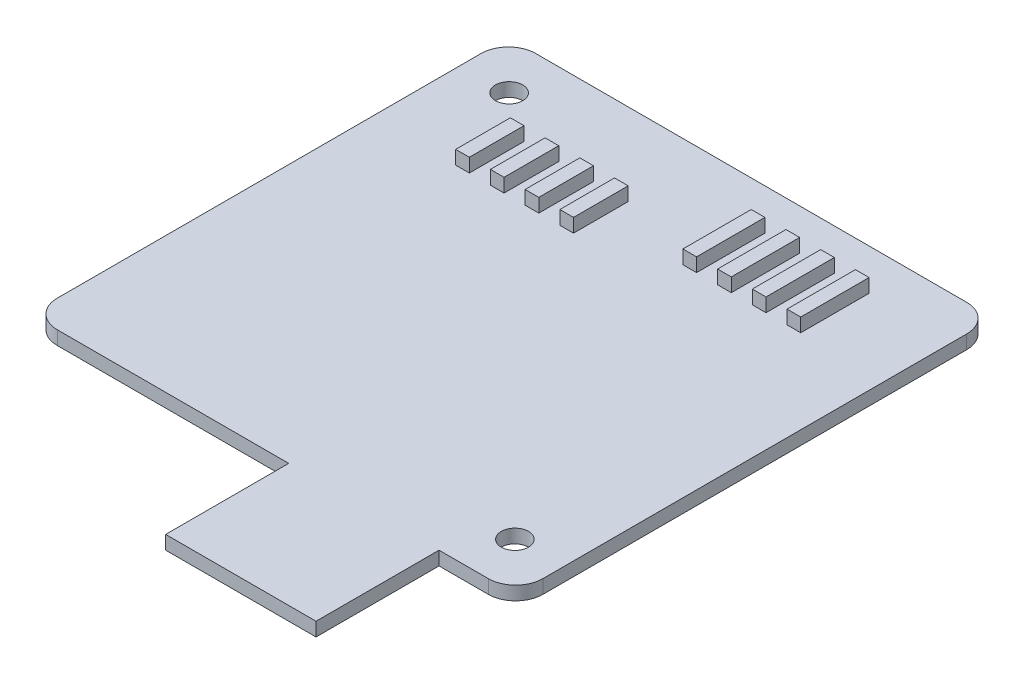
ISO-10303-21;
HEADER;
FILE_DESCRIPTION(('STEP AP214'),'2;1');
FILE_NAME('part.step','',(''),(''),'','','');
FILE_SCHEMA(('AUTOMOTIVE_DESIGN { 1 0 10303 214 1 1 1 1 }'));
ENDSEC;
DATA;
#1=APPLICATION_CONTEXT('core data for automotive mechanical design processes');
#2=APPLICATION_PROTOCOL_DEFINITION('international standard','automotive_design',2000,#1);
#3=PRODUCT_CONTEXT('',#1,'mechanical');
#4=PRODUCT('Part','Part','',(#3));
#5=PRODUCT_RELATED_PRODUCT_CATEGORY('part','',(#4));
#6=PRODUCT_DEFINITION_FORMATION('','',#4);
#7=PRODUCT_DEFINITION_CONTEXT('part definition',#1,'design');
#8=PRODUCT_DEFINITION('design','',#6,#7);
#9=PRODUCT_DEFINITION_SHAPE('','',#8);
#10=(LENGTH_UNIT() NAMED_UNIT(*) SI_UNIT(.MILLI.,.METRE.));
#11=(NAMED_UNIT(*) PLANE_ANGLE_UNIT() SI_UNIT($,.RADIAN.));
#12=(NAMED_UNIT(*) SI_UNIT($,.STERADIAN.) SOLID_ANGLE_UNIT());
#13=UNCERTAINTY_MEASURE_WITH_UNIT(LENGTH_MEASURE(1.E-05),#10,'distance_accuracy_value','');
#14=(GEOMETRIC_REPRESENTATION_CONTEXT(3) GLOBAL_UNCERTAINTY_ASSIGNED_CONTEXT((#13)) GLOBAL_UNIT_ASSIGNED_CONTEXT((#10,
#11,#12)) REPRESENTATION_CONTEXT('',''));
#15=CARTESIAN_POINT('',(0.,0.,0.));
#16=DIRECTION('',(0.,0.,1.));
#17=DIRECTION('',(1.,0.,0.));
#18=AXIS2_PLACEMENT_3D('',#15,#16,#17);
#19=CARTESIAN_POINT('',(-15.7638837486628,1.,15.5));
#20=DIRECTION('',(0.,-1.,0.));
#21=DIRECTION('',(0.,0.,-1.));
#22=AXIS2_PLACEMENT_3D('',#19,#20,#21);
#23=PLANE('',#22);
#24=DIRECTION('',(0.,0.,-1.));
#25=VECTOR('',#24,1.);
#26=CARTESIAN_POINT('',(-8.07999999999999,1.,-11.5));
#27=LINE('',#26,#25);
#28=CARTESIAN_POINT('',(-8.08,1.,-7.49999999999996));
#29=VERTEX_POINT('',#28);
#30=CARTESIAN_POINT('',(-8.07999999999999,1.,-11.5));
#31=VERTEX_POINT('',#30);
#32=EDGE_CURVE('E335',#29,#31,#27,.T.);
#33=ORIENTED_EDGE('',*,*,#32,.F.);
#34=DIRECTION('',(1.,0.,0.));
#35=VECTOR('',#34,1.);
#36=CARTESIAN_POINT('',(-8.08,1.,-7.49999999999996));
#37=LINE('',#36,#35);
#38=CARTESIAN_POINT('',(-9.08,1.,-7.49999999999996));
#39=VERTEX_POINT('',#38);
#40=EDGE_CURVE('E348',#39,#29,#37,.T.);
#41=ORIENTED_EDGE('',*,*,#40,.F.);
#42=DIRECTION('',(0.,0.,1.));
#43=VECTOR('',#42,1.);
#44=CARTESIAN_POINT('',(-9.08,1.,-11.5));
#45=LINE('',#44,#43);
#46=CARTESIAN_POINT('',(-9.08,1.,-11.5));
#47=VERTEX_POINT('',#46);
#48=EDGE_CURVE('E357',#47,#39,#45,.T.);
#49=ORIENTED_EDGE('',*,*,#48,.F.);
#50=DIRECTION('',(-1.,0.,0.));
#51=VECTOR('',#50,1.);
#52=CARTESIAN_POINT('',(-8.07999999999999,1.,-11.5));
#53=LINE('',#52,#51);
#54=EDGE_CURVE('E338',#31,#47,#53,.T.);
#55=ORIENTED_EDGE('',*,*,#54,.F.);
#56=EDGE_LOOP('',(#33,#41,#49,#55));
#57=FACE_BOUND('',#56,.T.);
#58=DIRECTION('',(0.,0.,1.));
#59=VECTOR('',#58,1.);
#60=CARTESIAN_POINT('',(10.62,1.,-14.5));
#61=LINE('',#60,#59);
#62=CARTESIAN_POINT('',(10.62,1.,-14.5));
#63=VERTEX_POINT('',#62);
#64=CARTESIAN_POINT('',(10.62,1.,-9.50000000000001));
#65=VERTEX_POINT('',#64);
#66=EDGE_CURVE('E406',#63,#65,#61,.T.);
#67=ORIENTED_EDGE('',*,*,#66,.F.);
#68=DIRECTION('',(-1.,0.,0.));
#69=VECTOR('',#68,1.);
#70=CARTESIAN_POINT('',(10.62,1.,-14.5));
#71=LINE('',#70,#69);
#72=CARTESIAN_POINT('',(11.62,1.,-14.5));
#73=VERTEX_POINT('',#72);
#74=EDGE_CURVE('E411',#73,#63,#71,.T.);
#75=ORIENTED_EDGE('',*,*,#74,.F.);
#76=DIRECTION('',(0.,0.,-1.));
#77=VECTOR('',#76,1.);
#78=CARTESIAN_POINT('',(11.62,1.,-14.5));
#79=LINE('',#78,#77);
#80=CARTESIAN_POINT('',(11.62,1.,-9.50000000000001));
#81=VERTEX_POINT('',#80);
#82=EDGE_CURVE('E423',#81,#73,#79,.T.);
#83=ORIENTED_EDGE('',*,*,#82,.F.);
#84=DIRECTION('',(1.,0.,0.));
#85=VECTOR('',#84,1.);
#86=CARTESIAN_POINT('',(10.62,1.,-9.50000000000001));
#87=LINE('',#86,#85);
#88=EDGE_CURVE('E420',#65,#81,#87,.T.);
#89=ORIENTED_EDGE('',*,*,#88,.F.);
#90=EDGE_LOOP('',(#67,#75,#83,#89));
#91=FACE_BOUND('',#90,.T.);
#92=DIRECTION('',(0.,0.,1.));
#93=VECTOR('',#92,1.);
#94=CARTESIAN_POINT('',(3.,1.,-14.5));
#95=LINE('',#94,#93);
#96=CARTESIAN_POINT('',(3.,1.,-14.5));
#97=VERTEX_POINT('',#96);
#98=CARTESIAN_POINT('',(3.,1.,-9.50000000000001));
#99=VERTEX_POINT('',#98);
#100=EDGE_CURVE('E472',#97,#99,#95,.T.);
#101=ORIENTED_EDGE('',*,*,#100,.F.);
#102=DIRECTION('',(-1.,0.,0.));
#103=VECTOR('',#102,1.);
#104=CARTESIAN_POINT('',(3.,1.,-14.5));
#105=LINE('',#104,#103);
#106=CARTESIAN_POINT('',(4.,1.,-14.5));
#107=VERTEX_POINT('',#106);
#108=EDGE_CURVE('E477',#107,#97,#105,.T.);
#109=ORIENTED_EDGE('',*,*,#108,.F.);
#110=DIRECTION('',(0.,0.,-1.));
#111=VECTOR('',#110,1.);
#112=CARTESIAN_POINT('',(4.,1.,-14.5));
#113=LINE('',#112,#111);
#114=CARTESIAN_POINT('',(4.,1.,-9.50000000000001));
#115=VERTEX_POINT('',#114);
#116=EDGE_CURVE('E489',#115,#107,#113,.T.);
#117=ORIENTED_EDGE('',*,*,#116,.F.);
#118=DIRECTION('',(1.,0.,0.));
#119=VECTOR('',#118,1.);
#120=CARTESIAN_POINT('',(3.,1.,-9.50000000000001));
#121=LINE('',#120,#119);
#122=EDGE_CURVE('E486',#99,#115,#121,.T.);
#123=ORIENTED_EDGE('',*,*,#122,.F.);
#124=EDGE_LOOP('',(#101,#109,#117,#123));
#125=FACE_BOUND('',#124,.T.);
#126=DIRECTION('',(0.,0.,-1.));
#127=VECTOR('',#126,1.);
#128=CARTESIAN_POINT('',(-3.,1.,-11.5));
#129=LINE('',#128,#127);
#130=CARTESIAN_POINT('',(-3.,1.,-7.5));
#131=VERTEX_POINT('',#130);
#132=CARTESIAN_POINT('',(-3.,1.,-11.5));
#133=VERTEX_POINT('',#132);
#134=EDGE_CURVE('E538',#131,#133,#129,.T.);
#135=ORIENTED_EDGE('',*,*,#134,.F.);
#136=DIRECTION('',(1.,0.,0.));
#137=VECTOR('',#136,1.);
#138=CARTESIAN_POINT('',(-3.,1.,-7.5));
#139=LINE('',#138,#137);
#140=CARTESIAN_POINT('',(-4.,1.,-7.5));
#141=VERTEX_POINT('',#140);
#142=EDGE_CURVE('E543',#141,#131,#139,.T.);
#143=ORIENTED_EDGE('',*,*,#142,.F.);
#144=DIRECTION('',(0.,0.,1.));
#145=VECTOR('',#144,1.);
#146=CARTESIAN_POINT('',(-4.,1.,-11.5));
#147=LINE('',#146,#145);
#148=CARTESIAN_POINT('',(-4.,1.,-11.5));
#149=VERTEX_POINT('',#148);
#150=EDGE_CURVE('E555',#149,#141,#147,.T.);
#151=ORIENTED_EDGE('',*,*,#150,.F.);
#152=DIRECTION('',(-1.,0.,0.));
#153=VECTOR('',#152,1.);
#154=CARTESIAN_POINT('',(-3.,1.,-11.5));
#155=LINE('',#154,#153);
#156=EDGE_CURVE('E552',#133,#149,#155,.T.);
#157=ORIENTED_EDGE('',*,*,#156,.F.);
#158=EDGE_LOOP('',(#135,#143,#151,#157));
#159=FACE_BOUND('',#158,.T.);
#160=CARTESIAN_POINT('',(-15.7638837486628,1.,15.5));
#161=DIRECTION('',(0.,1.,0.));
#162=DIRECTION('',(0.,0.,-1.));
#163=AXIS2_PLACEMENT_3D('',#160,#161,#162);
#164=CIRCLE('',#163,2.);
#165=CARTESIAN_POINT('',(-17.7638837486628,1.,15.5));
#166=VERTEX_POINT('',#165);
#167=CARTESIAN_POINT('',(-15.7638837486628,1.,17.5));
#168=VERTEX_POINT('',#167);
#169=EDGE_CURVE('E584',#166,#168,#164,.T.);
#170=ORIENTED_EDGE('',*,*,#169,.T.);
#171=DIRECTION('',(1.,0.,0.));
#172=VECTOR('',#171,1.);
#173=CARTESIAN_POINT('',(-15.7638837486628,1.,17.5));
#174=LINE('',#173,#172);
#175=CARTESIAN_POINT('',(1.16477703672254,1.,17.5));
#176=VERTEX_POINT('',#175);
#177=EDGE_CURVE('E587',#168,#176,#174,.T.);
#178=ORIENTED_EDGE('',*,*,#177,.T.);
#179=DIRECTION('',(0.,0.,1.));
#180=VECTOR('',#179,1.);
#181=CARTESIAN_POINT('',(1.16477703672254,1.,17.5));
#182=LINE('',#181,#180);
#183=CARTESIAN_POINT('',(1.16477703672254,1.,26.5));
#184=VERTEX_POINT('',#183);
#185=EDGE_CURVE('E590',#176,#184,#182,.T.);
#186=ORIENTED_EDGE('',*,*,#185,.T.);
#187=DIRECTION('',(1.,0.,0.));
#188=VECTOR('',#187,1.);
#189=CARTESIAN_POINT('',(1.16477703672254,1.,26.5));
#190=LINE('',#189,#188);
#191=CARTESIAN_POINT('',(12.1647770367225,1.,26.5));
#192=VERTEX_POINT('',#191);
#193=EDGE_CURVE('E592',#184,#192,#190,.T.);
#194=ORIENTED_EDGE('',*,*,#193,.T.);
#195=DIRECTION('',(0.,0.,-1.));
#196=VECTOR('',#195,1.);
#197=CARTESIAN_POINT('',(12.1647770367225,1.,17.5));
#198=LINE('',#197,#196);
#199=CARTESIAN_POINT('',(12.1647770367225,1.,17.5));
#200=VERTEX_POINT('',#199);
#201=EDGE_CURVE('E594',#192,#200,#198,.T.);
#202=ORIENTED_EDGE('',*,*,#201,.T.);
#203=DIRECTION('',(1.,0.,0.));
#204=VECTOR('',#203,1.);
#205=CARTESIAN_POINT('',(12.1647770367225,1.,17.5));
#206=LINE('',#205,#204);
#207=CARTESIAN_POINT('',(15.7638837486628,1.,17.5));
#208=VERTEX_POINT('',#207);
#209=EDGE_CURVE('E596',#200,#208,#206,.T.);
#210=ORIENTED_EDGE('',*,*,#209,.T.);
#211=CARTESIAN_POINT('',(15.7638837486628,1.,15.5));
#212=DIRECTION('',(0.,1.,0.));
#213=DIRECTION('',(0.,0.,1.));
#214=AXIS2_PLACEMENT_3D('',#211,#212,#213);
#215=CIRCLE('',#214,2.);
#216=CARTESIAN_POINT('',(17.7638837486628,1.,15.5));
#217=VERTEX_POINT('',#216);
#218=EDGE_CURVE('E598',#208,#217,#215,.T.);
#219=ORIENTED_EDGE('',*,*,#218,.T.);
#220=DIRECTION('',(0.,0.,-1.));
#221=VECTOR('',#220,1.);
#222=CARTESIAN_POINT('',(17.7638837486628,1.,15.5));
#223=LINE('',#222,#221);
#224=CARTESIAN_POINT('',(17.7638837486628,1.,-15.5));
#225=VERTEX_POINT('',#224);
#226=EDGE_CURVE('E600',#217,#225,#223,.T.);
#227=ORIENTED_EDGE('',*,*,#226,.T.);
#228=CARTESIAN_POINT('',(15.7638837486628,1.,-15.5));
#229=DIRECTION('',(0.,1.,0.));
#230=DIRECTION('',(0.,0.,-1.));
#231=AXIS2_PLACEMENT_3D('',#228,#229,#230);
#232=CIRCLE('',#231,2.);
#233=CARTESIAN_POINT('',(15.7638837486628,1.,-17.5));
#234=VERTEX_POINT('',#233);
#235=EDGE_CURVE('E602',#225,#234,#232,.T.);
#236=ORIENTED_EDGE('',*,*,#235,.T.);
#237=DIRECTION('',(-1.,0.,0.));
#238=VECTOR('',#237,1.);
#239=CARTESIAN_POINT('',(-15.7638837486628,1.,-17.5));
#240=LINE('',#239,#238);
#241=CARTESIAN_POINT('',(-15.7638837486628,1.,-17.5));
#242=VERTEX_POINT('',#241);
#243=EDGE_CURVE('E604',#234,#242,#240,.T.);
#244=ORIENTED_EDGE('',*,*,#243,.T.);
#245=CARTESIAN_POINT('',(-15.7638837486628,1.,-15.5));
#246=DIRECTION('',(0.,1.,0.));
#247=DIRECTION('',(0.,0.,-1.));
#248=AXIS2_PLACEMENT_3D('',#245,#246,#247);
#249=CIRCLE('',#248,2.);
#250=CARTESIAN_POINT('',(-17.7638837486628,1.,-15.5));
#251=VERTEX_POINT('',#250);
#252=EDGE_CURVE('E606',#242,#251,#249,.T.);
#253=ORIENTED_EDGE('',*,*,#252,.T.);
#254=DIRECTION('',(0.,0.,1.));
#255=VECTOR('',#254,1.);
#256=CARTESIAN_POINT('',(-17.7638837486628,1.,15.5));
#257=LINE('',#256,#255);
#258=EDGE_CURVE('E608',#251,#166,#257,.T.);
#259=ORIENTED_EDGE('',*,*,#258,.T.);
#260=EDGE_LOOP('',(#170,#178,#186,#194,#202,#210,#219,#227,#236,#244,#253,#259));
#261=FACE_BOUND('',#260,.T.);
#262=CARTESIAN_POINT('',(-14.2475639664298,1.,-14.0359153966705));
#263=DIRECTION('',(0.,1.,0.));
#264=DIRECTION('',(0.,0.,1.));
#265=AXIS2_PLACEMENT_3D('',#262,#263,#264);
#266=CIRCLE('',#265,1.);
#267=CARTESIAN_POINT('',(-14.2475639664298,1.,-13.0359153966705));
#268=VERTEX_POINT('',#267);
#269=EDGE_CURVE('E578',#268,#268,#266,.T.);
#270=ORIENTED_EDGE('',*,*,#269,.F.);
#271=EDGE_LOOP('',(#270));
#272=FACE_BOUND('',#271,.T.);
#273=CARTESIAN_POINT('',(14.2475639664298,1.,14.0359153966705));
#274=DIRECTION('',(0.,1.,0.));
#275=DIRECTION('',(0.,0.,1.));
#276=AXIS2_PLACEMENT_3D('',#273,#274,#275);
#277=CIRCLE('',#276,1.);
#278=CARTESIAN_POINT('',(14.2475639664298,1.,15.0359153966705));
#279=VERTEX_POINT('',#278);
#280=EDGE_CURVE('E572',#279,#279,#277,.T.);
#281=ORIENTED_EDGE('',*,*,#280,.F.);
#282=EDGE_LOOP('',(#281));
#283=FACE_BOUND('',#282,.T.);
#284=DIRECTION('',(0.,0.,1.));
#285=VECTOR('',#284,1.);
#286=CARTESIAN_POINT('',(5.54,1.,-14.5));
#287=LINE('',#286,#285);
#288=CARTESIAN_POINT('',(5.54,1.,-14.5));
#289=VERTEX_POINT('',#288);
#290=CARTESIAN_POINT('',(5.54,1.,-9.50000000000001));
#291=VERTEX_POINT('',#290);
#292=EDGE_CURVE('E505',#289,#291,#287,.T.);
#293=ORIENTED_EDGE('',*,*,#292,.F.);
#294=DIRECTION('',(-1.,0.,0.));
#295=VECTOR('',#294,1.);
#296=CARTESIAN_POINT('',(5.54,1.,-14.5));
#297=LINE('',#296,#295);
#298=CARTESIAN_POINT('',(6.53999999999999,1.,-14.5));
#299=VERTEX_POINT('',#298);
#300=EDGE_CURVE('E510',#299,#289,#297,.T.);
#301=ORIENTED_EDGE('',*,*,#300,.F.);
#302=DIRECTION('',(0.,0.,-1.));
#303=VECTOR('',#302,1.);
#304=CARTESIAN_POINT('',(6.54,1.,-14.5));
#305=LINE('',#304,#303);
#306=CARTESIAN_POINT('',(6.54,1.,-9.50000000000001));
#307=VERTEX_POINT('',#306);
#308=EDGE_CURVE('E522',#307,#299,#305,.T.);
#309=ORIENTED_EDGE('',*,*,#308,.F.);
#310=DIRECTION('',(1.,0.,0.));
#311=VECTOR('',#310,1.);
#312=CARTESIAN_POINT('',(5.54,1.,-9.50000000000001));
#313=LINE('',#312,#311);
#314=EDGE_CURVE('E519',#291,#307,#313,.T.);
#315=ORIENTED_EDGE('',*,*,#314,.F.);
#316=EDGE_LOOP('',(#293,#301,#309,#315));
#317=FACE_BOUND('',#316,.T.);
#318=DIRECTION('',(0.,0.,1.));
#319=VECTOR('',#318,1.);
#320=CARTESIAN_POINT('',(8.07999999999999,1.,-14.5));
#321=LINE('',#320,#319);
#322=CARTESIAN_POINT('',(8.07999999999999,1.,-14.5));
#323=VERTEX_POINT('',#322);
#324=CARTESIAN_POINT('',(8.07999999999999,1.,-9.50000000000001));
#325=VERTEX_POINT('',#324);
#326=EDGE_CURVE('E439',#323,#325,#321,.T.);
#327=ORIENTED_EDGE('',*,*,#326,.F.);
#328=DIRECTION('',(-1.,0.,0.));
#329=VECTOR('',#328,1.);
#330=CARTESIAN_POINT('',(8.07999999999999,1.,-14.5));
#331=LINE('',#330,#329);
#332=CARTESIAN_POINT('',(9.07999999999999,1.,-14.5));
#333=VERTEX_POINT('',#332);
#334=EDGE_CURVE('E444',#333,#323,#331,.T.);
#335=ORIENTED_EDGE('',*,*,#334,.F.);
#336=DIRECTION('',(0.,0.,-1.));
#337=VECTOR('',#336,1.);
#338=CARTESIAN_POINT('',(9.07999999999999,1.,-14.5));
#339=LINE('',#338,#337);
#340=CARTESIAN_POINT('',(9.07999999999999,1.,-9.50000000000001));
#341=VERTEX_POINT('',#340);
#342=EDGE_CURVE('E456',#341,#333,#339,.T.);
#343=ORIENTED_EDGE('',*,*,#342,.F.);
#344=DIRECTION('',(1.,0.,0.));
#345=VECTOR('',#344,1.);
#346=CARTESIAN_POINT('',(8.07999999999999,1.,-9.50000000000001));
#347=LINE('',#346,#345);
#348=EDGE_CURVE('E453',#325,#341,#347,.T.);
#349=ORIENTED_EDGE('',*,*,#348,.F.);
#350=EDGE_LOOP('',(#327,#335,#343,#349));
#351=FACE_BOUND('',#350,.T.);
#352=DIRECTION('',(0.,0.,-1.));
#353=VECTOR('',#352,1.);
#354=CARTESIAN_POINT('',(-5.54,1.,-11.5));
#355=LINE('',#354,#353);
#356=CARTESIAN_POINT('',(-5.54,1.,-7.49999999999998));
#357=VERTEX_POINT('',#356);
#358=CARTESIAN_POINT('',(-5.54,1.,-11.5));
#359=VERTEX_POINT('',#358);
#360=EDGE_CURVE('E373',#357,#359,#355,.T.);
#361=ORIENTED_EDGE('',*,*,#360,.F.);
#362=DIRECTION('',(1.,0.,0.));
#363=VECTOR('',#362,1.);
#364=CARTESIAN_POINT('',(-5.54,1.,-7.49999999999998));
#365=LINE('',#364,#363);
#366=CARTESIAN_POINT('',(-6.54,1.,-7.49999999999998));
#367=VERTEX_POINT('',#366);
#368=EDGE_CURVE('E378',#367,#357,#365,.T.);
#369=ORIENTED_EDGE('',*,*,#368,.F.);
#370=DIRECTION('',(0.,0.,1.));
#371=VECTOR('',#370,1.);
#372=CARTESIAN_POINT('',(-6.54,1.,-11.5));
#373=LINE('',#372,#371);
#374=CARTESIAN_POINT('',(-6.54,1.,-11.5));
#375=VERTEX_POINT('',#374);
#376=EDGE_CURVE('E390',#375,#367,#373,.T.);
#377=ORIENTED_EDGE('',*,*,#376,.F.);
#378=DIRECTION('',(-1.,0.,0.));
#379=VECTOR('',#378,1.);
#380=CARTESIAN_POINT('',(-5.54,1.,-11.5));
#381=LINE('',#380,#379);
#382=EDGE_CURVE('E387',#359,#375,#381,.T.);
#383=ORIENTED_EDGE('',*,*,#382,.F.);
#384=EDGE_LOOP('',(#361,#369,#377,#383));
#385=FACE_BOUND('',#384,.T.);
#386=DIRECTION('',(0.,0.,-1.));
#387=VECTOR('',#386,1.);
#388=CARTESIAN_POINT('',(-10.62,1.,-11.4999999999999));
#389=LINE('',#388,#387);
#390=CARTESIAN_POINT('',(-10.62,1.,-7.49999999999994));
#391=VERTEX_POINT('',#390);
#392=CARTESIAN_POINT('',(-10.62,1.,-11.4999999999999));
#393=VERTEX_POINT('',#392);
#394=EDGE_CURVE('E334',#391,#393,#389,.T.);
#395=ORIENTED_EDGE('',*,*,#394,.F.);
#396=DIRECTION('',(1.,0.,0.));
#397=VECTOR('',#396,1.);
#398=CARTESIAN_POINT('',(-10.62,1.,-7.49999999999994));
#399=LINE('',#398,#397);
#400=CARTESIAN_POINT('',(-11.62,1.,-7.49999999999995));
#401=VERTEX_POINT('',#400);
#402=EDGE_CURVE('E331',#401,#391,#399,.T.);
#403=ORIENTED_EDGE('',*,*,#402,.F.);
#404=DIRECTION('',(0.,0.,1.));
#405=VECTOR('',#404,1.);
#406=CARTESIAN_POINT('',(-11.62,1.,-11.4999999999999));
#407=LINE('',#406,#405);
#408=CARTESIAN_POINT('',(-11.62,1.,-11.4999999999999));
#409=VERTEX_POINT('',#408);
#410=EDGE_CURVE('E53',#409,#401,#407,.T.);
#411=ORIENTED_EDGE('',*,*,#410,.F.);
#412=DIRECTION('',(-1.,0.,0.));
#413=VECTOR('',#412,1.);
#414=CARTESIAN_POINT('',(-10.62,1.,-11.4999999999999));
#415=LINE('',#414,#413);
#416=EDGE_CURVE('E48',#393,#409,#415,.T.);
#417=ORIENTED_EDGE('',*,*,#416,.F.);
#418=EDGE_LOOP('',(#395,#403,#411,#417));
#419=FACE_BOUND('',#418,.T.);
#420=ADVANCED_FACE('F33',(#57,#91,#125,#159,#261,#272,#283,#317,#351,#385,#419),#23,.F.);
#421=CARTESIAN_POINT('',(-15.7638837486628,0.,15.5));
#422=DIRECTION('',(0.,-1.,0.));
#423=DIRECTION('',(0.,0.,-1.));
#424=AXIS2_PLACEMENT_3D('',#421,#422,#423);
#425=PLANE('',#424);
#426=CARTESIAN_POINT('',(-14.2475639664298,0.,-14.0359153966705));
#427=DIRECTION('',(0.,1.,0.));
#428=DIRECTION('',(0.,0.,1.));
#429=AXIS2_PLACEMENT_3D('',#426,#427,#428);
#430=CIRCLE('',#429,1.);
#431=CARTESIAN_POINT('',(-14.2475639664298,0.,-13.0359153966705));
#432=VERTEX_POINT('',#431);
#433=EDGE_CURVE('E575',#432,#432,#430,.T.);
#434=ORIENTED_EDGE('',*,*,#433,.T.);
#435=EDGE_LOOP('',(#434));
#436=FACE_BOUND('',#435,.T.);
#437=CARTESIAN_POINT('',(-15.7638837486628,0.,15.5));
#438=DIRECTION('',(0.,1.,0.));
#439=DIRECTION('',(0.,0.,-1.));
#440=AXIS2_PLACEMENT_3D('',#437,#438,#439);
#441=CIRCLE('',#440,2.);
#442=CARTESIAN_POINT('',(-17.7638837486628,0.,15.5));
#443=VERTEX_POINT('',#442);
#444=CARTESIAN_POINT('',(-15.7638837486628,0.,17.5));
#445=VERTEX_POINT('',#444);
#446=EDGE_CURVE('E581',#443,#445,#441,.T.);
#447=ORIENTED_EDGE('',*,*,#446,.F.);
#448=DIRECTION('',(0.,0.,1.));
#449=VECTOR('',#448,1.);
#450=CARTESIAN_POINT('',(-17.7638837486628,0.,15.5));
#451=LINE('',#450,#449);
#452=CARTESIAN_POINT('',(-17.7638837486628,0.,-15.5));
#453=VERTEX_POINT('',#452);
#454=EDGE_CURVE('E588',#453,#443,#451,.T.);
#455=ORIENTED_EDGE('',*,*,#454,.F.);
#456=CARTESIAN_POINT('',(-15.7638837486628,0.,-15.5));
#457=DIRECTION('',(0.,1.,0.));
#458=DIRECTION('',(0.,0.,-1.));
#459=AXIS2_PLACEMENT_3D('',#456,#457,#458);
#460=CIRCLE('',#459,2.);
#461=CARTESIAN_POINT('',(-15.7638837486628,0.,-17.5));
#462=VERTEX_POINT('',#461);
#463=EDGE_CURVE('E631',#462,#453,#460,.T.);
#464=ORIENTED_EDGE('',*,*,#463,.F.);
#465=DIRECTION('',(-1.,0.,0.));
#466=VECTOR('',#465,1.);
#467=CARTESIAN_POINT('',(-15.7638837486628,0.,-17.5));
#468=LINE('',#467,#466);
#469=CARTESIAN_POINT('',(15.7638837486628,0.,-17.5));
#470=VERTEX_POINT('',#469);
#471=EDGE_CURVE('E629',#470,#462,#468,.T.);
#472=ORIENTED_EDGE('',*,*,#471,.F.);
#473=CARTESIAN_POINT('',(15.7638837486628,0.,-15.5));
#474=DIRECTION('',(0.,1.,0.));
#475=DIRECTION('',(0.,0.,-1.));
#476=AXIS2_PLACEMENT_3D('',#473,#474,#475);
#477=CIRCLE('',#476,2.);
#478=CARTESIAN_POINT('',(17.7638837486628,0.,-15.5));
#479=VERTEX_POINT('',#478);
#480=EDGE_CURVE('E627',#479,#470,#477,.T.);
#481=ORIENTED_EDGE('',*,*,#480,.F.);
#482=DIRECTION('',(0.,0.,-1.));
#483=VECTOR('',#482,1.);
#484=CARTESIAN_POINT('',(17.7638837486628,0.,15.5));
#485=LINE('',#484,#483);
#486=CARTESIAN_POINT('',(17.7638837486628,0.,15.5));
#487=VERTEX_POINT('',#486);
#488=EDGE_CURVE('E625',#487,#479,#485,.T.);
#489=ORIENTED_EDGE('',*,*,#488,.F.);
#490=CARTESIAN_POINT('',(15.7638837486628,0.,15.5));
#491=DIRECTION('',(0.,1.,0.));
#492=DIRECTION('',(0.,0.,1.));
#493=AXIS2_PLACEMENT_3D('',#490,#491,#492);
#494=CIRCLE('',#493,2.);
#495=CARTESIAN_POINT('',(15.7638837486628,0.,17.5));
#496=VERTEX_POINT('',#495);
#497=EDGE_CURVE('E623',#496,#487,#494,.T.);
#498=ORIENTED_EDGE('',*,*,#497,.F.);
#499=DIRECTION('',(1.,0.,0.));
#500=VECTOR('',#499,1.);
#501=CARTESIAN_POINT('',(12.1647770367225,0.,17.5));
#502=LINE('',#501,#500);
#503=CARTESIAN_POINT('',(12.1647770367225,0.,17.5));
#504=VERTEX_POINT('',#503);
#505=EDGE_CURVE('E621',#504,#496,#502,.T.);
#506=ORIENTED_EDGE('',*,*,#505,.F.);
#507=DIRECTION('',(0.,0.,-1.));
#508=VECTOR('',#507,1.);
#509=CARTESIAN_POINT('',(12.1647770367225,0.,17.5));
#510=LINE('',#509,#508);
#511=CARTESIAN_POINT('',(12.1647770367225,0.,26.5));
#512=VERTEX_POINT('',#511);
#513=EDGE_CURVE('E619',#512,#504,#510,.T.);
#514=ORIENTED_EDGE('',*,*,#513,.F.);
#515=DIRECTION('',(1.,0.,0.));
#516=VECTOR('',#515,1.);
#517=CARTESIAN_POINT('',(1.16477703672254,0.,26.5));
#518=LINE('',#517,#516);
#519=CARTESIAN_POINT('',(1.16477703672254,0.,26.5));
#520=VERTEX_POINT('',#519);
#521=EDGE_CURVE('E617',#520,#512,#518,.T.);
#522=ORIENTED_EDGE('',*,*,#521,.F.);
#523=DIRECTION('',(0.,0.,1.));
#524=VECTOR('',#523,1.);
#525=CARTESIAN_POINT('',(1.16477703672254,0.,17.5));
#526=LINE('',#525,#524);
#527=CARTESIAN_POINT('',(1.16477703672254,0.,17.5));
#528=VERTEX_POINT('',#527);
#529=EDGE_CURVE('E615',#528,#520,#526,.T.);
#530=ORIENTED_EDGE('',*,*,#529,.F.);
#531=DIRECTION('',(1.,0.,0.));
#532=VECTOR('',#531,1.);
#533=CARTESIAN_POINT('',(-15.7638837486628,0.,17.5));
#534=LINE('',#533,#532);
#535=EDGE_CURVE('E613',#445,#528,#534,.T.);
#536=ORIENTED_EDGE('',*,*,#535,.F.);
#537=EDGE_LOOP('',(#447,#455,#464,#472,#481,#489,#498,#506,#514,#522,#530,#536));
#538=FACE_BOUND('',#537,.T.);
#539=CARTESIAN_POINT('',(14.2475639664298,0.,14.0359153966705));
#540=DIRECTION('',(0.,1.,0.));
#541=DIRECTION('',(0.,0.,1.));
#542=AXIS2_PLACEMENT_3D('',#539,#540,#541);
#543=CIRCLE('',#542,1.);
#544=CARTESIAN_POINT('',(14.2475639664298,0.,15.0359153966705));
#545=VERTEX_POINT('',#544);
#546=EDGE_CURVE('E571',#545,#545,#543,.T.);
#547=ORIENTED_EDGE('',*,*,#546,.T.);
#548=EDGE_LOOP('',(#547));
#549=FACE_BOUND('',#548,.T.);
#550=ADVANCED_FACE('F673',(#436,#538,#549),#425,.T.);
#551=CARTESIAN_POINT('',(-15.7638837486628,1.,15.5));
#552=DIRECTION('',(0.,-1.,0.));
#553=DIRECTION('',(0.,0.,-1.));
#554=AXIS2_PLACEMENT_3D('',#551,#552,#553);
#555=CYLINDRICAL_SURFACE('',#554,2.);
#556=ORIENTED_EDGE('',*,*,#446,.T.);
#557=DIRECTION('',(0.,-1.,0.));
#558=VECTOR('',#557,1.);
#559=CARTESIAN_POINT('',(-15.7638837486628,1.,17.5));
#560=LINE('',#559,#558);
#561=EDGE_CURVE('E11',#168,#445,#560,.T.);
#562=ORIENTED_EDGE('',*,*,#561,.F.);
#563=ORIENTED_EDGE('',*,*,#169,.F.);
#564=DIRECTION('',(0.,-1.,0.));
#565=VECTOR('',#564,1.);
#566=CARTESIAN_POINT('',(-17.7638837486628,1.,15.5));
#567=LINE('',#566,#565);
#568=EDGE_CURVE('E610',#166,#443,#567,.T.);
#569=ORIENTED_EDGE('',*,*,#568,.T.);
#570=EDGE_LOOP('',(#556,#562,#563,#569));
#571=FACE_BOUND('',#570,.T.);
#572=ADVANCED_FACE('F35',(#571),#555,.T.);
#573=CARTESIAN_POINT('',(-15.7638837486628,1.,17.5));
#574=DIRECTION('',(0.,0.,-1.));
#575=DIRECTION('',(-1.,0.,0.));
#576=AXIS2_PLACEMENT_3D('',#573,#574,#575);
#577=PLANE('',#576);
#578=ORIENTED_EDGE('',*,*,#535,.T.);
#579=DIRECTION('',(0.,-1.,0.));
#580=VECTOR('',#579,1.);
#581=CARTESIAN_POINT('',(1.16477703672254,1.,17.5));
#582=LINE('',#581,#580);
#583=EDGE_CURVE('E41',#176,#528,#582,.T.);
#584=ORIENTED_EDGE('',*,*,#583,.F.);
#585=ORIENTED_EDGE('',*,*,#177,.F.);
#586=ORIENTED_EDGE('',*,*,#561,.T.);
#587=EDGE_LOOP('',(#578,#584,#585,#586));
#588=FACE_BOUND('',#587,.T.);
#589=ADVANCED_FACE('F691',(#588),#577,.F.);
#590=CARTESIAN_POINT('',(1.16477703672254,1.,17.5));
#591=DIRECTION('',(1.,0.,0.));
#592=DIRECTION('',(0.,0.,-1.));
#593=AXIS2_PLACEMENT_3D('',#590,#591,#592);
#594=PLANE('',#593);
#595=ORIENTED_EDGE('',*,*,#529,.T.);
#596=DIRECTION('',(0.,-1.,0.));
#597=VECTOR('',#596,1.);
#598=CARTESIAN_POINT('',(1.16477703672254,1.,26.5));
#599=LINE('',#598,#597);
#600=EDGE_CURVE('E660',#184,#520,#599,.T.);
#601=ORIENTED_EDGE('',*,*,#600,.F.);
#602=ORIENTED_EDGE('',*,*,#185,.F.);
#603=ORIENTED_EDGE('',*,*,#583,.T.);
#604=EDGE_LOOP('',(#595,#601,#602,#603));
#605=FACE_BOUND('',#604,.T.);
#606=ADVANCED_FACE('F667',(#605),#594,.F.);
#607=CARTESIAN_POINT('',(1.16477703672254,1.,26.5));
#608=DIRECTION('',(0.,0.,-1.));
#609=DIRECTION('',(-1.,0.,0.));
#610=AXIS2_PLACEMENT_3D('',#607,#608,#609);
#611=PLANE('',#610);
#612=ORIENTED_EDGE('',*,*,#521,.T.);
#613=DIRECTION('',(0.,-1.,0.));
#614=VECTOR('',#613,1.);
#615=CARTESIAN_POINT('',(12.1647770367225,1.,26.5));
#616=LINE('',#615,#614);
#617=EDGE_CURVE('E657',#192,#512,#616,.T.);
#618=ORIENTED_EDGE('',*,*,#617,.F.);
#619=ORIENTED_EDGE('',*,*,#193,.F.);
#620=ORIENTED_EDGE('',*,*,#600,.T.);
#621=EDGE_LOOP('',(#612,#618,#619,#620));
#622=FACE_BOUND('',#621,.T.);
#623=ADVANCED_FACE('F679',(#622),#611,.F.);
#624=CARTESIAN_POINT('',(12.1647770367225,1.,17.5));
#625=DIRECTION('',(-1.,0.,0.));
#626=DIRECTION('',(0.,0.,1.));
#627=AXIS2_PLACEMENT_3D('',#624,#625,#626);
#628=PLANE('',#627);
#629=ORIENTED_EDGE('',*,*,#513,.T.);
#630=DIRECTION('',(0.,-1.,0.));
#631=VECTOR('',#630,1.);
#632=CARTESIAN_POINT('',(12.1647770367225,1.,17.5));
#633=LINE('',#632,#631);
#634=EDGE_CURVE('E654',#200,#504,#633,.T.);
#635=ORIENTED_EDGE('',*,*,#634,.F.);
#636=ORIENTED_EDGE('',*,*,#201,.F.);
#637=ORIENTED_EDGE('',*,*,#617,.T.);
#638=EDGE_LOOP('',(#629,#635,#636,#637));
#639=FACE_BOUND('',#638,.T.);
#640=ADVANCED_FACE('F683',(#639),#628,.F.);
#641=CARTESIAN_POINT('',(12.1647770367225,1.,17.5));
#642=DIRECTION('',(0.,0.,-1.));
#643=DIRECTION('',(-1.,0.,0.));
#644=AXIS2_PLACEMENT_3D('',#641,#642,#643);
#645=PLANE('',#644);
#646=ORIENTED_EDGE('',*,*,#505,.T.);
#647=DIRECTION('',(0.,-1.,0.));
#648=VECTOR('',#647,1.);
#649=CARTESIAN_POINT('',(15.7638837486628,1.,17.5));
#650=LINE('',#649,#648);
#651=EDGE_CURVE('E651',#208,#496,#650,.T.);
#652=ORIENTED_EDGE('',*,*,#651,.F.);
#653=ORIENTED_EDGE('',*,*,#209,.F.);
#654=ORIENTED_EDGE('',*,*,#634,.T.);
#655=EDGE_LOOP('',(#646,#652,#653,#654));
#656=FACE_BOUND('',#655,.T.);
#657=ADVANCED_FACE('F724',(#656),#645,.F.);
#658=CARTESIAN_POINT('',(15.7638837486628,1.,15.5));
#659=DIRECTION('',(0.,-1.,0.));
#660=DIRECTION('',(0.,0.,-1.));
#661=AXIS2_PLACEMENT_3D('',#658,#659,#660);
#662=CYLINDRICAL_SURFACE('',#661,2.);
#663=ORIENTED_EDGE('',*,*,#497,.T.);
#664=DIRECTION('',(0.,-1.,0.));
#665=VECTOR('',#664,1.);
#666=CARTESIAN_POINT('',(17.7638837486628,1.,15.5));
#667=LINE('',#666,#665);
#668=EDGE_CURVE('E648',#217,#487,#667,.T.);
#669=ORIENTED_EDGE('',*,*,#668,.F.);
#670=ORIENTED_EDGE('',*,*,#218,.F.);
#671=ORIENTED_EDGE('',*,*,#651,.T.);
#672=EDGE_LOOP('',(#663,#669,#670,#671));
#673=FACE_BOUND('',#672,.T.);
#674=ADVANCED_FACE('F722',(#673),#662,.T.);
#675=CARTESIAN_POINT('',(17.7638837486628,1.,15.5));
#676=DIRECTION('',(-1.,0.,0.));
#677=DIRECTION('',(0.,0.,1.));
#678=AXIS2_PLACEMENT_3D('',#675,#676,#677);
#679=PLANE('',#678);
#680=ORIENTED_EDGE('',*,*,#488,.T.);
#681=DIRECTION('',(0.,-1.,0.));
#682=VECTOR('',#681,1.);
#683=CARTESIAN_POINT('',(17.7638837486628,1.,-15.5));
#684=LINE('',#683,#682);
#685=EDGE_CURVE('E645',#225,#479,#684,.T.);
#686=ORIENTED_EDGE('',*,*,#685,.F.);
#687=ORIENTED_EDGE('',*,*,#226,.F.);
#688=ORIENTED_EDGE('',*,*,#668,.T.);
#689=EDGE_LOOP('',(#680,#686,#687,#688));
#690=FACE_BOUND('',#689,.T.);
#691=ADVANCED_FACE('F718',(#690),#679,.F.);
#692=CARTESIAN_POINT('',(15.7638837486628,1.,-15.5));
#693=DIRECTION('',(0.,-1.,0.));
#694=DIRECTION('',(0.,0.,-1.));
#695=AXIS2_PLACEMENT_3D('',#692,#693,#694);
#696=CYLINDRICAL_SURFACE('',#695,2.);
#697=ORIENTED_EDGE('',*,*,#480,.T.);
#698=DIRECTION('',(0.,-1.,0.));
#699=VECTOR('',#698,1.);
#700=CARTESIAN_POINT('',(15.7638837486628,1.,-17.5));
#701=LINE('',#700,#699);
#702=EDGE_CURVE('E642',#234,#470,#701,.T.);
#703=ORIENTED_EDGE('',*,*,#702,.F.);
#704=ORIENTED_EDGE('',*,*,#235,.F.);
#705=ORIENTED_EDGE('',*,*,#685,.T.);
#706=EDGE_LOOP('',(#697,#703,#704,#705));
#707=FACE_BOUND('',#706,.T.);
#708=ADVANCED_FACE('F713',(#707),#696,.T.);
#709=CARTESIAN_POINT('',(-15.7638837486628,1.,-17.5));
#710=DIRECTION('',(0.,0.,1.));
#711=DIRECTION('',(1.,0.,0.));
#712=AXIS2_PLACEMENT_3D('',#709,#710,#711);
#713=PLANE('',#712);
#714=ORIENTED_EDGE('',*,*,#471,.T.);
#715=DIRECTION('',(0.,-1.,0.));
#716=VECTOR('',#715,1.);
#717=CARTESIAN_POINT('',(-15.7638837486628,1.,-17.5));
#718=LINE('',#717,#716);
#719=EDGE_CURVE('E639',#242,#462,#718,.T.);
#720=ORIENTED_EDGE('',*,*,#719,.F.);
#721=ORIENTED_EDGE('',*,*,#243,.F.);
#722=ORIENTED_EDGE('',*,*,#702,.T.);
#723=EDGE_LOOP('',(#714,#720,#721,#722));
#724=FACE_BOUND('',#723,.T.);
#725=ADVANCED_FACE('F707',(#724),#713,.F.);
#726=CARTESIAN_POINT('',(-15.7638837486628,1.,-15.5));
#727=DIRECTION('',(0.,-1.,0.));
#728=DIRECTION('',(0.,0.,-1.));
#729=AXIS2_PLACEMENT_3D('',#726,#727,#728);
#730=CYLINDRICAL_SURFACE('',#729,2.);
#731=ORIENTED_EDGE('',*,*,#463,.T.);
#732=DIRECTION('',(0.,-1.,0.));
#733=VECTOR('',#732,1.);
#734=CARTESIAN_POINT('',(-17.7638837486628,1.,-15.5));
#735=LINE('',#734,#733);
#736=EDGE_CURVE('E636',#251,#453,#735,.T.);
#737=ORIENTED_EDGE('',*,*,#736,.F.);
#738=ORIENTED_EDGE('',*,*,#252,.F.);
#739=ORIENTED_EDGE('',*,*,#719,.T.);
#740=EDGE_LOOP('',(#731,#737,#738,#739));
#741=FACE_BOUND('',#740,.T.);
#742=ADVANCED_FACE('F703',(#741),#730,.T.);
#743=CARTESIAN_POINT('',(-17.7638837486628,1.,15.5));
#744=DIRECTION('',(1.,0.,0.));
#745=DIRECTION('',(0.,0.,-1.));
#746=AXIS2_PLACEMENT_3D('',#743,#744,#745);
#747=PLANE('',#746);
#748=ORIENTED_EDGE('',*,*,#454,.T.);
#749=ORIENTED_EDGE('',*,*,#568,.F.);
#750=ORIENTED_EDGE('',*,*,#258,.F.);
#751=ORIENTED_EDGE('',*,*,#736,.T.);
#752=EDGE_LOOP('',(#748,#749,#750,#751));
#753=FACE_BOUND('',#752,.T.);
#754=ADVANCED_FACE('F698',(#753),#747,.F.);
#755=CARTESIAN_POINT('',(-14.2475639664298,1.,-14.0359153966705));
#756=DIRECTION('',(0.,-1.,0.));
#757=DIRECTION('',(0.,0.,-1.));
#758=AXIS2_PLACEMENT_3D('',#755,#756,#757);
#759=CYLINDRICAL_SURFACE('',#758,1.);
#760=ORIENTED_EDGE('',*,*,#269,.T.);
#761=EDGE_LOOP('',(#760));
#762=FACE_BOUND('',#761,.T.);
#763=ORIENTED_EDGE('',*,*,#433,.F.);
#764=EDGE_LOOP('',(#763));
#765=FACE_BOUND('',#764,.T.);
#766=ADVANCED_FACE('F743',(#762,#765),#759,.F.);
#767=CARTESIAN_POINT('',(14.2475639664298,1.,14.0359153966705));
#768=DIRECTION('',(0.,-1.,0.));
#769=DIRECTION('',(0.,0.,-1.));
#770=AXIS2_PLACEMENT_3D('',#767,#768,#769);
#771=CYLINDRICAL_SURFACE('',#770,1.);
#772=ORIENTED_EDGE('',*,*,#280,.T.);
#773=EDGE_LOOP('',(#772));
#774=FACE_BOUND('',#773,.T.);
#775=ORIENTED_EDGE('',*,*,#546,.F.);
#776=EDGE_LOOP('',(#775));
#777=FACE_BOUND('',#776,.T.);
#778=ADVANCED_FACE('F781',(#774,#777),#771,.F.);
#779=CARTESIAN_POINT('',(-3.,2.,-11.5));
#780=DIRECTION('',(-1.,0.,0.));
#781=DIRECTION('',(0.,0.,1.));
#782=AXIS2_PLACEMENT_3D('',#779,#780,#781);
#783=PLANE('',#782);
#784=ORIENTED_EDGE('',*,*,#134,.T.);
#785=DIRECTION('',(0.,-1.,0.));
#786=VECTOR('',#785,1.);
#787=CARTESIAN_POINT('',(-3.,2.,-11.5));
#788=LINE('',#787,#786);
#789=CARTESIAN_POINT('',(-3.,2.,-11.5));
#790=VERTEX_POINT('',#789);
#791=EDGE_CURVE('E568',#790,#133,#788,.T.);
#792=ORIENTED_EDGE('',*,*,#791,.F.);
#793=DIRECTION('',(0.,0.,-1.));
#794=VECTOR('',#793,1.);
#795=CARTESIAN_POINT('',(-3.,2.,-11.5));
#796=LINE('',#795,#794);
#797=CARTESIAN_POINT('',(-3.,2.,-7.5));
#798=VERTEX_POINT('',#797);
#799=EDGE_CURVE('E539',#798,#790,#796,.T.);
#800=ORIENTED_EDGE('',*,*,#799,.F.);
#801=DIRECTION('',(0.,-1.,0.));
#802=VECTOR('',#801,1.);
#803=CARTESIAN_POINT('',(-3.,2.,-7.5));
#804=LINE('',#803,#802);
#805=EDGE_CURVE('E549',#798,#131,#804,.T.);
#806=ORIENTED_EDGE('',*,*,#805,.T.);
#807=EDGE_LOOP('',(#784,#792,#800,#806));
#808=FACE_BOUND('',#807,.T.);
#809=ADVANCED_FACE('F788',(#808),#783,.F.);
#810=CARTESIAN_POINT('',(-3.,2.,-11.5));
#811=DIRECTION('',(0.,0.,1.));
#812=DIRECTION('',(1.,0.,0.));
#813=AXIS2_PLACEMENT_3D('',#810,#811,#812);
#814=PLANE('',#813);
#815=ORIENTED_EDGE('',*,*,#156,.T.);
#816=DIRECTION('',(0.,-1.,0.));
#817=VECTOR('',#816,1.);
#818=CARTESIAN_POINT('',(-4.,2.,-11.5));
#819=LINE('',#818,#817);
#820=CARTESIAN_POINT('',(-4.,2.,-11.5));
#821=VERTEX_POINT('',#820);
#822=EDGE_CURVE('E565',#821,#149,#819,.T.);
#823=ORIENTED_EDGE('',*,*,#822,.F.);
#824=DIRECTION('',(-1.,0.,0.));
#825=VECTOR('',#824,1.);
#826=CARTESIAN_POINT('',(-3.,2.,-11.5));
#827=LINE('',#826,#825);
#828=EDGE_CURVE('E542',#790,#821,#827,.T.);
#829=ORIENTED_EDGE('',*,*,#828,.F.);
#830=ORIENTED_EDGE('',*,*,#791,.T.);
#831=EDGE_LOOP('',(#815,#823,#829,#830));
#832=FACE_BOUND('',#831,.T.);
#833=ADVANCED_FACE('F795',(#832),#814,.F.);
#834=CARTESIAN_POINT('',(-4.,2.,-11.5));
#835=DIRECTION('',(1.,0.,0.));
#836=DIRECTION('',(0.,0.,-1.));
#837=AXIS2_PLACEMENT_3D('',#834,#835,#836);
#838=PLANE('',#837);
#839=ORIENTED_EDGE('',*,*,#150,.T.);
#840=DIRECTION('',(0.,-1.,0.));
#841=VECTOR('',#840,1.);
#842=CARTESIAN_POINT('',(-4.,2.,-7.5));
#843=LINE('',#842,#841);
#844=CARTESIAN_POINT('',(-4.,2.,-7.5));
#845=VERTEX_POINT('',#844);
#846=EDGE_CURVE('E562',#845,#141,#843,.T.);
#847=ORIENTED_EDGE('',*,*,#846,.F.);
#848=DIRECTION('',(0.,0.,1.));
#849=VECTOR('',#848,1.);
#850=CARTESIAN_POINT('',(-4.,2.,-11.5));
#851=LINE('',#850,#849);
#852=EDGE_CURVE('E545',#821,#845,#851,.T.);
#853=ORIENTED_EDGE('',*,*,#852,.F.);
#854=ORIENTED_EDGE('',*,*,#822,.T.);
#855=EDGE_LOOP('',(#839,#847,#853,#854));
#856=FACE_BOUND('',#855,.T.);
#857=ADVANCED_FACE('F803',(#856),#838,.F.);
#858=CARTESIAN_POINT('',(-3.,2.,-7.5));
#859=DIRECTION('',(0.,0.,-1.));
#860=DIRECTION('',(-1.,0.,0.));
#861=AXIS2_PLACEMENT_3D('',#858,#859,#860);
#862=PLANE('',#861);
#863=ORIENTED_EDGE('',*,*,#142,.T.);
#864=ORIENTED_EDGE('',*,*,#805,.F.);
#865=DIRECTION('',(1.,0.,0.));
#866=VECTOR('',#865,1.);
#867=CARTESIAN_POINT('',(-3.,2.,-7.5));
#868=LINE('',#867,#866);
#869=EDGE_CURVE('E547',#845,#798,#868,.T.);
#870=ORIENTED_EDGE('',*,*,#869,.F.);
#871=ORIENTED_EDGE('',*,*,#846,.T.);
#872=EDGE_LOOP('',(#863,#864,#870,#871));
#873=FACE_BOUND('',#872,.T.);
#874=ADVANCED_FACE('F811',(#873),#862,.F.);
#875=CARTESIAN_POINT('',(0.,2.,0.));
#876=DIRECTION('',(0.,-1.,0.));
#877=DIRECTION('',(0.,0.,-1.));
#878=AXIS2_PLACEMENT_3D('',#875,#876,#877);
#879=PLANE('',#878);
#880=ORIENTED_EDGE('',*,*,#799,.T.);
#881=ORIENTED_EDGE('',*,*,#828,.T.);
#882=ORIENTED_EDGE('',*,*,#852,.T.);
#883=ORIENTED_EDGE('',*,*,#869,.T.);
#884=EDGE_LOOP('',(#880,#881,#882,#883));
#885=FACE_BOUND('',#884,.T.);
#886=ADVANCED_FACE('F819',(#885),#879,.F.);
#887=CARTESIAN_POINT('',(5.54,2.,-14.5));
#888=DIRECTION('',(1.,0.,0.));
#889=DIRECTION('',(0.,0.,-1.));
#890=AXIS2_PLACEMENT_3D('',#887,#888,#889);
#891=PLANE('',#890);
#892=ORIENTED_EDGE('',*,*,#292,.T.);
#893=DIRECTION('',(0.,-1.,0.));
#894=VECTOR('',#893,1.);
#895=CARTESIAN_POINT('',(5.54,2.,-9.50000000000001));
#896=LINE('',#895,#894);
#897=CARTESIAN_POINT('',(5.54,2.,-9.50000000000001));
#898=VERTEX_POINT('',#897);
#899=EDGE_CURVE('E535',#898,#291,#896,.T.);
#900=ORIENTED_EDGE('',*,*,#899,.F.);
#901=DIRECTION('',(0.,0.,1.));
#902=VECTOR('',#901,1.);
#903=CARTESIAN_POINT('',(5.54,2.,-14.5));
#904=LINE('',#903,#902);
#905=CARTESIAN_POINT('',(5.54,2.,-14.5));
#906=VERTEX_POINT('',#905);
#907=EDGE_CURVE('E506',#906,#898,#904,.T.);
#908=ORIENTED_EDGE('',*,*,#907,.F.);
#909=DIRECTION('',(0.,-1.,0.));
#910=VECTOR('',#909,1.);
#911=CARTESIAN_POINT('',(5.54,2.,-14.5));
#912=LINE('',#911,#910);
#913=EDGE_CURVE('E516',#906,#289,#912,.T.);
#914=ORIENTED_EDGE('',*,*,#913,.T.);
#915=EDGE_LOOP('',(#892,#900,#908,#914));
#916=FACE_BOUND('',#915,.T.);
#917=ADVANCED_FACE('F827',(#916),#891,.F.);
#918=CARTESIAN_POINT('',(5.54,2.,-9.50000000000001));
#919=DIRECTION('',(0.,0.,-1.));
#920=DIRECTION('',(-1.,0.,0.));
#921=AXIS2_PLACEMENT_3D('',#918,#919,#920);
#922=PLANE('',#921);
#923=ORIENTED_EDGE('',*,*,#314,.T.);
#924=DIRECTION('',(0.,-1.,0.));
#925=VECTOR('',#924,1.);
#926=CARTESIAN_POINT('',(6.54,2.,-9.50000000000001));
#927=LINE('',#926,#925);
#928=CARTESIAN_POINT('',(6.54,2.,-9.50000000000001));
#929=VERTEX_POINT('',#928);
#930=EDGE_CURVE('E532',#929,#307,#927,.T.);
#931=ORIENTED_EDGE('',*,*,#930,.F.);
#932=DIRECTION('',(1.,0.,0.));
#933=VECTOR('',#932,1.);
#934=CARTESIAN_POINT('',(5.54,2.,-9.50000000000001));
#935=LINE('',#934,#933);
#936=EDGE_CURVE('E509',#898,#929,#935,.T.);
#937=ORIENTED_EDGE('',*,*,#936,.F.);
#938=ORIENTED_EDGE('',*,*,#899,.T.);
#939=EDGE_LOOP('',(#923,#931,#937,#938));
#940=FACE_BOUND('',#939,.T.);
#941=ADVANCED_FACE('F835',(#940),#922,.F.);
#942=CARTESIAN_POINT('',(6.54,2.,-14.5));
#943=DIRECTION('',(-1.,0.,0.));
#944=DIRECTION('',(0.,0.,1.));
#945=AXIS2_PLACEMENT_3D('',#942,#943,#944);
#946=PLANE('',#945);
#947=ORIENTED_EDGE('',*,*,#308,.T.);
#948=DIRECTION('',(0.,-1.,0.));
#949=VECTOR('',#948,1.);
#950=CARTESIAN_POINT('',(6.54,2.,-14.5));
#951=LINE('',#950,#949);
#952=CARTESIAN_POINT('',(6.54,2.,-14.5));
#953=VERTEX_POINT('',#952);
#954=EDGE_CURVE('E529',#953,#299,#951,.T.);
#955=ORIENTED_EDGE('',*,*,#954,.F.);
#956=DIRECTION('',(0.,0.,-1.));
#957=VECTOR('',#956,1.);
#958=CARTESIAN_POINT('',(6.54,2.,-14.5));
#959=LINE('',#958,#957);
#960=EDGE_CURVE('E512',#929,#953,#959,.T.);
#961=ORIENTED_EDGE('',*,*,#960,.F.);
#962=ORIENTED_EDGE('',*,*,#930,.T.);
#963=EDGE_LOOP('',(#947,#955,#961,#962));
#964=FACE_BOUND('',#963,.T.);
#965=ADVANCED_FACE('F843',(#964),#946,.F.);
#966=CARTESIAN_POINT('',(5.54,2.,-14.5));
#967=DIRECTION('',(0.,0.,1.));
#968=DIRECTION('',(1.,0.,0.));
#969=AXIS2_PLACEMENT_3D('',#966,#967,#968);
#970=PLANE('',#969);
#971=ORIENTED_EDGE('',*,*,#300,.T.);
#972=ORIENTED_EDGE('',*,*,#913,.F.);
#973=DIRECTION('',(-1.,0.,0.));
#974=VECTOR('',#973,1.);
#975=CARTESIAN_POINT('',(5.54,2.,-14.5));
#976=LINE('',#975,#974);
#977=EDGE_CURVE('E514',#953,#906,#976,.T.);
#978=ORIENTED_EDGE('',*,*,#977,.F.);
#979=ORIENTED_EDGE('',*,*,#954,.T.);
#980=EDGE_LOOP('',(#971,#972,#978,#979));
#981=FACE_BOUND('',#980,.T.);
#982=ADVANCED_FACE('F851',(#981),#970,.F.);
#983=CARTESIAN_POINT('',(0.,2.,0.));
#984=DIRECTION('',(0.,1.,0.));
#985=DIRECTION('',(0.,0.,1.));
#986=AXIS2_PLACEMENT_3D('',#983,#984,#985);
#987=PLANE('',#986);
#988=ORIENTED_EDGE('',*,*,#907,.T.);
#989=ORIENTED_EDGE('',*,*,#936,.T.);
#990=ORIENTED_EDGE('',*,*,#960,.T.);
#991=ORIENTED_EDGE('',*,*,#977,.T.);
#992=EDGE_LOOP('',(#988,#989,#990,#991));
#993=FACE_BOUND('',#992,.T.);
#994=ADVANCED_FACE('F859',(#993),#987,.T.);
#995=CARTESIAN_POINT('',(3.,2.,-14.5));
#996=DIRECTION('',(1.,0.,0.));
#997=DIRECTION('',(0.,0.,-1.));
#998=AXIS2_PLACEMENT_3D('',#995,#996,#997);
#999=PLANE('',#998);
#1000=ORIENTED_EDGE('',*,*,#100,.T.);
#1001=DIRECTION('',(0.,-1.,0.));
#1002=VECTOR('',#1001,1.);
#1003=CARTESIAN_POINT('',(3.,2.,-9.50000000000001));
#1004=LINE('',#1003,#1002);
#1005=CARTESIAN_POINT('',(3.,2.,-9.50000000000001));
#1006=VERTEX_POINT('',#1005);
#1007=EDGE_CURVE('E502',#1006,#99,#1004,.T.);
#1008=ORIENTED_EDGE('',*,*,#1007,.F.);
#1009=DIRECTION('',(0.,0.,1.));
#1010=VECTOR('',#1009,1.);
#1011=CARTESIAN_POINT('',(3.,2.,-14.5));
#1012=LINE('',#1011,#1010);
#1013=CARTESIAN_POINT('',(3.,2.,-14.5));
#1014=VERTEX_POINT('',#1013);
#1015=EDGE_CURVE('E473',#1014,#1006,#1012,.T.);
#1016=ORIENTED_EDGE('',*,*,#1015,.F.);
#1017=DIRECTION('',(0.,-1.,0.));
#1018=VECTOR('',#1017,1.);
#1019=CARTESIAN_POINT('',(3.,2.,-14.5));
#1020=LINE('',#1019,#1018);
#1021=EDGE_CURVE('E483',#1014,#97,#1020,.T.);
#1022=ORIENTED_EDGE('',*,*,#1021,.T.);
#1023=EDGE_LOOP('',(#1000,#1008,#1016,#1022));
#1024=FACE_BOUND('',#1023,.T.);
#1025=ADVANCED_FACE('F867',(#1024),#999,.F.);
#1026=CARTESIAN_POINT('',(3.,2.,-9.50000000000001));
#1027=DIRECTION('',(0.,0.,-1.));
#1028=DIRECTION('',(-1.,0.,0.));
#1029=AXIS2_PLACEMENT_3D('',#1026,#1027,#1028);
#1030=PLANE('',#1029);
#1031=ORIENTED_EDGE('',*,*,#122,.T.);
#1032=DIRECTION('',(0.,-1.,0.));
#1033=VECTOR('',#1032,1.);
#1034=CARTESIAN_POINT('',(4.,2.,-9.50000000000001));
#1035=LINE('',#1034,#1033);
#1036=CARTESIAN_POINT('',(4.,2.,-9.50000000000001));
#1037=VERTEX_POINT('',#1036);
#1038=EDGE_CURVE('E499',#1037,#115,#1035,.T.);
#1039=ORIENTED_EDGE('',*,*,#1038,.F.);
#1040=DIRECTION('',(1.,0.,0.));
#1041=VECTOR('',#1040,1.);
#1042=CARTESIAN_POINT('',(3.,2.,-9.50000000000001));
#1043=LINE('',#1042,#1041);
#1044=EDGE_CURVE('E476',#1006,#1037,#1043,.T.);
#1045=ORIENTED_EDGE('',*,*,#1044,.F.);
#1046=ORIENTED_EDGE('',*,*,#1007,.T.);
#1047=EDGE_LOOP('',(#1031,#1039,#1045,#1046));
#1048=FACE_BOUND('',#1047,.T.);
#1049=ADVANCED_FACE('F875',(#1048),#1030,.F.);
#1050=CARTESIAN_POINT('',(4.,2.,-14.5));
#1051=DIRECTION('',(-1.,0.,0.));
#1052=DIRECTION('',(0.,0.,1.));
#1053=AXIS2_PLACEMENT_3D('',#1050,#1051,#1052);
#1054=PLANE('',#1053);
#1055=ORIENTED_EDGE('',*,*,#116,.T.);
#1056=DIRECTION('',(0.,-1.,0.));
#1057=VECTOR('',#1056,1.);
#1058=CARTESIAN_POINT('',(4.,2.,-14.5));
#1059=LINE('',#1058,#1057);
#1060=CARTESIAN_POINT('',(4.,2.,-14.5));
#1061=VERTEX_POINT('',#1060);
#1062=EDGE_CURVE('E496',#1061,#107,#1059,.T.);
#1063=ORIENTED_EDGE('',*,*,#1062,.F.);
#1064=DIRECTION('',(0.,0.,-1.));
#1065=VECTOR('',#1064,1.);
#1066=CARTESIAN_POINT('',(4.,2.,-14.5));
#1067=LINE('',#1066,#1065);
#1068=EDGE_CURVE('E479',#1037,#1061,#1067,.T.);
#1069=ORIENTED_EDGE('',*,*,#1068,.F.);
#1070=ORIENTED_EDGE('',*,*,#1038,.T.);
#1071=EDGE_LOOP('',(#1055,#1063,#1069,#1070));
#1072=FACE_BOUND('',#1071,.T.);
#1073=ADVANCED_FACE('F883',(#1072),#1054,.F.);
#1074=CARTESIAN_POINT('',(3.,2.,-14.5));
#1075=DIRECTION('',(0.,0.,1.));
#1076=DIRECTION('',(1.,0.,0.));
#1077=AXIS2_PLACEMENT_3D('',#1074,#1075,#1076);
#1078=PLANE('',#1077);
#1079=ORIENTED_EDGE('',*,*,#108,.T.);
#1080=ORIENTED_EDGE('',*,*,#1021,.F.);
#1081=DIRECTION('',(-1.,0.,0.));
#1082=VECTOR('',#1081,1.);
#1083=CARTESIAN_POINT('',(3.,2.,-14.5));
#1084=LINE('',#1083,#1082);
#1085=EDGE_CURVE('E481',#1061,#1014,#1084,.T.);
#1086=ORIENTED_EDGE('',*,*,#1085,.F.);
#1087=ORIENTED_EDGE('',*,*,#1062,.T.);
#1088=EDGE_LOOP('',(#1079,#1080,#1086,#1087));
#1089=FACE_BOUND('',#1088,.T.);
#1090=ADVANCED_FACE('F891',(#1089),#1078,.F.);
#1091=CARTESIAN_POINT('',(0.,2.,0.));
#1092=DIRECTION('',(0.,1.,0.));
#1093=DIRECTION('',(0.,0.,1.));
#1094=AXIS2_PLACEMENT_3D('',#1091,#1092,#1093);
#1095=PLANE('',#1094);
#1096=ORIENTED_EDGE('',*,*,#1015,.T.);
#1097=ORIENTED_EDGE('',*,*,#1044,.T.);
#1098=ORIENTED_EDGE('',*,*,#1068,.T.);
#1099=ORIENTED_EDGE('',*,*,#1085,.T.);
#1100=EDGE_LOOP('',(#1096,#1097,#1098,#1099));
#1101=FACE_BOUND('',#1100,.T.);
#1102=ADVANCED_FACE('F899',(#1101),#1095,.T.);
#1103=CARTESIAN_POINT('',(8.07999999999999,2.,-14.5));
#1104=DIRECTION('',(1.,0.,0.));
#1105=DIRECTION('',(0.,0.,-1.));
#1106=AXIS2_PLACEMENT_3D('',#1103,#1104,#1105);
#1107=PLANE('',#1106);
#1108=ORIENTED_EDGE('',*,*,#326,.T.);
#1109=DIRECTION('',(0.,-1.,0.));
#1110=VECTOR('',#1109,1.);
#1111=CARTESIAN_POINT('',(8.07999999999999,2.,-9.50000000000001));
#1112=LINE('',#1111,#1110);
#1113=CARTESIAN_POINT('',(8.07999999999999,2.,-9.50000000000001));
#1114=VERTEX_POINT('',#1113);
#1115=EDGE_CURVE('E469',#1114,#325,#1112,.T.);
#1116=ORIENTED_EDGE('',*,*,#1115,.F.);
#1117=DIRECTION('',(0.,0.,1.));
#1118=VECTOR('',#1117,1.);
#1119=CARTESIAN_POINT('',(8.07999999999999,2.,-14.5));
#1120=LINE('',#1119,#1118);
#1121=CARTESIAN_POINT('',(8.07999999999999,2.,-14.5));
#1122=VERTEX_POINT('',#1121);
#1123=EDGE_CURVE('E440',#1122,#1114,#1120,.T.);
#1124=ORIENTED_EDGE('',*,*,#1123,.F.);
#1125=DIRECTION('',(0.,-1.,0.));
#1126=VECTOR('',#1125,1.);
#1127=CARTESIAN_POINT('',(8.07999999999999,2.,-14.5));
#1128=LINE('',#1127,#1126);
#1129=EDGE_CURVE('E450',#1122,#323,#1128,.T.);
#1130=ORIENTED_EDGE('',*,*,#1129,.T.);
#1131=EDGE_LOOP('',(#1108,#1116,#1124,#1130));
#1132=FACE_BOUND('',#1131,.T.);
#1133=ADVANCED_FACE('F907',(#1132),#1107,.F.);
#1134=CARTESIAN_POINT('',(8.07999999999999,2.,-9.50000000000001));
#1135=DIRECTION('',(0.,0.,-1.));
#1136=DIRECTION('',(-1.,0.,0.));
#1137=AXIS2_PLACEMENT_3D('',#1134,#1135,#1136);
#1138=PLANE('',#1137);
#1139=ORIENTED_EDGE('',*,*,#348,.T.);
#1140=DIRECTION('',(0.,-1.,0.));
#1141=VECTOR('',#1140,1.);
#1142=CARTESIAN_POINT('',(9.07999999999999,2.,-9.50000000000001));
#1143=LINE('',#1142,#1141);
#1144=CARTESIAN_POINT('',(9.07999999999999,2.,-9.50000000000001));
#1145=VERTEX_POINT('',#1144);
#1146=EDGE_CURVE('E466',#1145,#341,#1143,.T.);
#1147=ORIENTED_EDGE('',*,*,#1146,.F.);
#1148=DIRECTION('',(1.,0.,0.));
#1149=VECTOR('',#1148,1.);
#1150=CARTESIAN_POINT('',(8.07999999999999,2.,-9.50000000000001));
#1151=LINE('',#1150,#1149);
#1152=EDGE_CURVE('E443',#1114,#1145,#1151,.T.);
#1153=ORIENTED_EDGE('',*,*,#1152,.F.);
#1154=ORIENTED_EDGE('',*,*,#1115,.T.);
#1155=EDGE_LOOP('',(#1139,#1147,#1153,#1154));
#1156=FACE_BOUND('',#1155,.T.);
#1157=ADVANCED_FACE('F915',(#1156),#1138,.F.);
#1158=CARTESIAN_POINT('',(9.07999999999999,2.,-14.5));
#1159=DIRECTION('',(-1.,0.,0.));
#1160=DIRECTION('',(0.,0.,1.));
#1161=AXIS2_PLACEMENT_3D('',#1158,#1159,#1160);
#1162=PLANE('',#1161);
#1163=ORIENTED_EDGE('',*,*,#342,.T.);
#1164=DIRECTION('',(0.,-1.,0.));
#1165=VECTOR('',#1164,1.);
#1166=CARTESIAN_POINT('',(9.07999999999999,2.,-14.5));
#1167=LINE('',#1166,#1165);
#1168=CARTESIAN_POINT('',(9.07999999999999,2.,-14.5));
#1169=VERTEX_POINT('',#1168);
#1170=EDGE_CURVE('E463',#1169,#333,#1167,.T.);
#1171=ORIENTED_EDGE('',*,*,#1170,.F.);
#1172=DIRECTION('',(0.,0.,-1.));
#1173=VECTOR('',#1172,1.);
#1174=CARTESIAN_POINT('',(9.07999999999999,2.,-14.5));
#1175=LINE('',#1174,#1173);
#1176=EDGE_CURVE('E446',#1145,#1169,#1175,.T.);
#1177=ORIENTED_EDGE('',*,*,#1176,.F.);
#1178=ORIENTED_EDGE('',*,*,#1146,.T.);
#1179=EDGE_LOOP('',(#1163,#1171,#1177,#1178));
#1180=FACE_BOUND('',#1179,.T.);
#1181=ADVANCED_FACE('F923',(#1180),#1162,.F.);
#1182=CARTESIAN_POINT('',(8.07999999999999,2.,-14.5));
#1183=DIRECTION('',(0.,0.,1.));
#1184=DIRECTION('',(1.,0.,0.));
#1185=AXIS2_PLACEMENT_3D('',#1182,#1183,#1184);
#1186=PLANE('',#1185);
#1187=ORIENTED_EDGE('',*,*,#334,.T.);
#1188=ORIENTED_EDGE('',*,*,#1129,.F.);
#1189=DIRECTION('',(-1.,0.,0.));
#1190=VECTOR('',#1189,1.);
#1191=CARTESIAN_POINT('',(8.07999999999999,2.,-14.5));
#1192=LINE('',#1191,#1190);
#1193=EDGE_CURVE('E448',#1169,#1122,#1192,.T.);
#1194=ORIENTED_EDGE('',*,*,#1193,.F.);
#1195=ORIENTED_EDGE('',*,*,#1170,.T.);
#1196=EDGE_LOOP('',(#1187,#1188,#1194,#1195));
#1197=FACE_BOUND('',#1196,.T.);
#1198=ADVANCED_FACE('F931',(#1197),#1186,.F.);
#1199=CARTESIAN_POINT('',(0.,2.,0.));
#1200=DIRECTION('',(0.,1.,0.));
#1201=DIRECTION('',(0.,0.,1.));
#1202=AXIS2_PLACEMENT_3D('',#1199,#1200,#1201);
#1203=PLANE('',#1202);
#1204=ORIENTED_EDGE('',*,*,#1123,.T.);
#1205=ORIENTED_EDGE('',*,*,#1152,.T.);
#1206=ORIENTED_EDGE('',*,*,#1176,.T.);
#1207=ORIENTED_EDGE('',*,*,#1193,.T.);
#1208=EDGE_LOOP('',(#1204,#1205,#1206,#1207));
#1209=FACE_BOUND('',#1208,.T.);
#1210=ADVANCED_FACE('F939',(#1209),#1203,.T.);
#1211=CARTESIAN_POINT('',(10.62,2.,-14.5));
#1212=DIRECTION('',(1.,0.,0.));
#1213=DIRECTION('',(0.,0.,-1.));
#1214=AXIS2_PLACEMENT_3D('',#1211,#1212,#1213);
#1215=PLANE('',#1214);
#1216=ORIENTED_EDGE('',*,*,#66,.T.);
#1217=DIRECTION('',(0.,-1.,0.));
#1218=VECTOR('',#1217,1.);
#1219=CARTESIAN_POINT('',(10.62,2.,-9.50000000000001));
#1220=LINE('',#1219,#1218);
#1221=CARTESIAN_POINT('',(10.62,2.,-9.50000000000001));
#1222=VERTEX_POINT('',#1221);
#1223=EDGE_CURVE('E436',#1222,#65,#1220,.T.);
#1224=ORIENTED_EDGE('',*,*,#1223,.F.);
#1225=DIRECTION('',(0.,0.,1.));
#1226=VECTOR('',#1225,1.);
#1227=CARTESIAN_POINT('',(10.62,2.,-14.5));
#1228=LINE('',#1227,#1226);
#1229=CARTESIAN_POINT('',(10.62,2.,-14.5));
#1230=VERTEX_POINT('',#1229);
#1231=EDGE_CURVE('E407',#1230,#1222,#1228,.T.);
#1232=ORIENTED_EDGE('',*,*,#1231,.F.);
#1233=DIRECTION('',(0.,-1.,0.));
#1234=VECTOR('',#1233,1.);
#1235=CARTESIAN_POINT('',(10.62,2.,-14.5));
#1236=LINE('',#1235,#1234);
#1237=EDGE_CURVE('E417',#1230,#63,#1236,.T.);
#1238=ORIENTED_EDGE('',*,*,#1237,.T.);
#1239=EDGE_LOOP('',(#1216,#1224,#1232,#1238));
#1240=FACE_BOUND('',#1239,.T.);
#1241=ADVANCED_FACE('F947',(#1240),#1215,.F.);
#1242=CARTESIAN_POINT('',(10.62,2.,-9.50000000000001));
#1243=DIRECTION('',(0.,0.,-1.));
#1244=DIRECTION('',(-1.,0.,0.));
#1245=AXIS2_PLACEMENT_3D('',#1242,#1243,#1244);
#1246=PLANE('',#1245);
#1247=ORIENTED_EDGE('',*,*,#88,.T.);
#1248=DIRECTION('',(0.,-1.,0.));
#1249=VECTOR('',#1248,1.);
#1250=CARTESIAN_POINT('',(11.62,2.,-9.50000000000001));
#1251=LINE('',#1250,#1249);
#1252=CARTESIAN_POINT('',(11.62,2.,-9.50000000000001));
#1253=VERTEX_POINT('',#1252);
#1254=EDGE_CURVE('E433',#1253,#81,#1251,.T.);
#1255=ORIENTED_EDGE('',*,*,#1254,.F.);
#1256=DIRECTION('',(1.,0.,0.));
#1257=VECTOR('',#1256,1.);
#1258=CARTESIAN_POINT('',(10.62,2.,-9.50000000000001));
#1259=LINE('',#1258,#1257);
#1260=EDGE_CURVE('E410',#1222,#1253,#1259,.T.);
#1261=ORIENTED_EDGE('',*,*,#1260,.F.);
#1262=ORIENTED_EDGE('',*,*,#1223,.T.);
#1263=EDGE_LOOP('',(#1247,#1255,#1261,#1262));
#1264=FACE_BOUND('',#1263,.T.);
#1265=ADVANCED_FACE('F955',(#1264),#1246,.F.);
#1266=CARTESIAN_POINT('',(11.62,2.,-14.5));
#1267=DIRECTION('',(-1.,0.,0.));
#1268=DIRECTION('',(0.,0.,1.));
#1269=AXIS2_PLACEMENT_3D('',#1266,#1267,#1268);
#1270=PLANE('',#1269);
#1271=ORIENTED_EDGE('',*,*,#82,.T.);
#1272=DIRECTION('',(0.,-1.,0.));
#1273=VECTOR('',#1272,1.);
#1274=CARTESIAN_POINT('',(11.62,2.,-14.5));
#1275=LINE('',#1274,#1273);
#1276=CARTESIAN_POINT('',(11.62,2.,-14.5));
#1277=VERTEX_POINT('',#1276);
#1278=EDGE_CURVE('E430',#1277,#73,#1275,.T.);
#1279=ORIENTED_EDGE('',*,*,#1278,.F.);
#1280=DIRECTION('',(0.,0.,-1.));
#1281=VECTOR('',#1280,1.);
#1282=CARTESIAN_POINT('',(11.62,2.,-14.5));
#1283=LINE('',#1282,#1281);
#1284=EDGE_CURVE('E413',#1253,#1277,#1283,.T.);
#1285=ORIENTED_EDGE('',*,*,#1284,.F.);
#1286=ORIENTED_EDGE('',*,*,#1254,.T.);
#1287=EDGE_LOOP('',(#1271,#1279,#1285,#1286));
#1288=FACE_BOUND('',#1287,.T.);
#1289=ADVANCED_FACE('F963',(#1288),#1270,.F.);
#1290=CARTESIAN_POINT('',(10.62,2.,-14.5));
#1291=DIRECTION('',(0.,0.,1.));
#1292=DIRECTION('',(1.,0.,0.));
#1293=AXIS2_PLACEMENT_3D('',#1290,#1291,#1292);
#1294=PLANE('',#1293);
#1295=ORIENTED_EDGE('',*,*,#74,.T.);
#1296=ORIENTED_EDGE('',*,*,#1237,.F.);
#1297=DIRECTION('',(-1.,0.,0.));
#1298=VECTOR('',#1297,1.);
#1299=CARTESIAN_POINT('',(10.62,2.,-14.5));
#1300=LINE('',#1299,#1298);
#1301=EDGE_CURVE('E415',#1277,#1230,#1300,.T.);
#1302=ORIENTED_EDGE('',*,*,#1301,.F.);
#1303=ORIENTED_EDGE('',*,*,#1278,.T.);
#1304=EDGE_LOOP('',(#1295,#1296,#1302,#1303));
#1305=FACE_BOUND('',#1304,.T.);
#1306=ADVANCED_FACE('F971',(#1305),#1294,.F.);
#1307=CARTESIAN_POINT('',(0.,2.,0.));
#1308=DIRECTION('',(0.,1.,0.));
#1309=DIRECTION('',(0.,0.,1.));
#1310=AXIS2_PLACEMENT_3D('',#1307,#1308,#1309);
#1311=PLANE('',#1310);
#1312=ORIENTED_EDGE('',*,*,#1231,.T.);
#1313=ORIENTED_EDGE('',*,*,#1260,.T.);
#1314=ORIENTED_EDGE('',*,*,#1284,.T.);
#1315=ORIENTED_EDGE('',*,*,#1301,.T.);
#1316=EDGE_LOOP('',(#1312,#1313,#1314,#1315));
#1317=FACE_BOUND('',#1316,.T.);
#1318=ADVANCED_FACE('F979',(#1317),#1311,.T.);
#1319=CARTESIAN_POINT('',(-5.54,2.,-11.5));
#1320=DIRECTION('',(-1.,0.,0.));
#1321=DIRECTION('',(0.,0.,1.));
#1322=AXIS2_PLACEMENT_3D('',#1319,#1320,#1321);
#1323=PLANE('',#1322);
#1324=ORIENTED_EDGE('',*,*,#360,.T.);
#1325=DIRECTION('',(0.,-1.,0.));
#1326=VECTOR('',#1325,1.);
#1327=CARTESIAN_POINT('',(-5.54,2.,-11.5));
#1328=LINE('',#1327,#1326);
#1329=CARTESIAN_POINT('',(-5.54,2.,-11.5));
#1330=VERTEX_POINT('',#1329);
#1331=EDGE_CURVE('E403',#1330,#359,#1328,.T.);
#1332=ORIENTED_EDGE('',*,*,#1331,.F.);
#1333=DIRECTION('',(0.,0.,-1.));
#1334=VECTOR('',#1333,1.);
#1335=CARTESIAN_POINT('',(-5.54,2.,-11.5));
#1336=LINE('',#1335,#1334);
#1337=CARTESIAN_POINT('',(-5.54,2.,-7.49999999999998));
#1338=VERTEX_POINT('',#1337);
#1339=EDGE_CURVE('E374',#1338,#1330,#1336,.T.);
#1340=ORIENTED_EDGE('',*,*,#1339,.F.);
#1341=DIRECTION('',(0.,-1.,0.));
#1342=VECTOR('',#1341,1.);
#1343=CARTESIAN_POINT('',(-5.54,2.,-7.49999999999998));
#1344=LINE('',#1343,#1342);
#1345=EDGE_CURVE('E384',#1338,#357,#1344,.T.);
#1346=ORIENTED_EDGE('',*,*,#1345,.T.);
#1347=EDGE_LOOP('',(#1324,#1332,#1340,#1346));
#1348=FACE_BOUND('',#1347,.T.);
#1349=ADVANCED_FACE('F987',(#1348),#1323,.F.);
#1350=CARTESIAN_POINT('',(-5.54,2.,-11.5));
#1351=DIRECTION('',(0.,0.,1.));
#1352=DIRECTION('',(1.,0.,0.));
#1353=AXIS2_PLACEMENT_3D('',#1350,#1351,#1352);
#1354=PLANE('',#1353);
#1355=ORIENTED_EDGE('',*,*,#382,.T.);
#1356=DIRECTION('',(0.,-1.,0.));
#1357=VECTOR('',#1356,1.);
#1358=CARTESIAN_POINT('',(-6.54,2.,-11.5));
#1359=LINE('',#1358,#1357);
#1360=CARTESIAN_POINT('',(-6.54,2.,-11.5));
#1361=VERTEX_POINT('',#1360);
#1362=EDGE_CURVE('E400',#1361,#375,#1359,.T.);
#1363=ORIENTED_EDGE('',*,*,#1362,.F.);
#1364=DIRECTION('',(-1.,0.,0.));
#1365=VECTOR('',#1364,1.);
#1366=CARTESIAN_POINT('',(-5.54,2.,-11.5));
#1367=LINE('',#1366,#1365);
#1368=EDGE_CURVE('E377',#1330,#1361,#1367,.T.);
#1369=ORIENTED_EDGE('',*,*,#1368,.F.);
#1370=ORIENTED_EDGE('',*,*,#1331,.T.);
#1371=EDGE_LOOP('',(#1355,#1363,#1369,#1370));
#1372=FACE_BOUND('',#1371,.T.);
#1373=ADVANCED_FACE('F995',(#1372),#1354,.F.);
#1374=CARTESIAN_POINT('',(-6.54,2.,-11.5));
#1375=DIRECTION('',(1.,0.,0.));
#1376=DIRECTION('',(0.,0.,-1.));
#1377=AXIS2_PLACEMENT_3D('',#1374,#1375,#1376);
#1378=PLANE('',#1377);
#1379=ORIENTED_EDGE('',*,*,#376,.T.);
#1380=DIRECTION('',(0.,-1.,0.));
#1381=VECTOR('',#1380,1.);
#1382=CARTESIAN_POINT('',(-6.54,2.,-7.49999999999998));
#1383=LINE('',#1382,#1381);
#1384=CARTESIAN_POINT('',(-6.54,2.,-7.49999999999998));
#1385=VERTEX_POINT('',#1384);
#1386=EDGE_CURVE('E397',#1385,#367,#1383,.T.);
#1387=ORIENTED_EDGE('',*,*,#1386,.F.);
#1388=DIRECTION('',(0.,0.,1.));
#1389=VECTOR('',#1388,1.);
#1390=CARTESIAN_POINT('',(-6.54,2.,-11.5));
#1391=LINE('',#1390,#1389);
#1392=EDGE_CURVE('E380',#1361,#1385,#1391,.T.);
#1393=ORIENTED_EDGE('',*,*,#1392,.F.);
#1394=ORIENTED_EDGE('',*,*,#1362,.T.);
#1395=EDGE_LOOP('',(#1379,#1387,#1393,#1394));
#1396=FACE_BOUND('',#1395,.T.);
#1397=ADVANCED_FACE('F1003',(#1396),#1378,.F.);
#1398=CARTESIAN_POINT('',(-5.54,2.,-7.49999999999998));
#1399=DIRECTION('',(0.,0.,-1.));
#1400=DIRECTION('',(-1.,0.,0.));
#1401=AXIS2_PLACEMENT_3D('',#1398,#1399,#1400);
#1402=PLANE('',#1401);
#1403=ORIENTED_EDGE('',*,*,#368,.T.);
#1404=ORIENTED_EDGE('',*,*,#1345,.F.);
#1405=DIRECTION('',(1.,0.,0.));
#1406=VECTOR('',#1405,1.);
#1407=CARTESIAN_POINT('',(-5.54,2.,-7.49999999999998));
#1408=LINE('',#1407,#1406);
#1409=EDGE_CURVE('E382',#1385,#1338,#1408,.T.);
#1410=ORIENTED_EDGE('',*,*,#1409,.F.);
#1411=ORIENTED_EDGE('',*,*,#1386,.T.);
#1412=EDGE_LOOP('',(#1403,#1404,#1410,#1411));
#1413=FACE_BOUND('',#1412,.T.);
#1414=ADVANCED_FACE('F1011',(#1413),#1402,.F.);
#1415=CARTESIAN_POINT('',(0.,2.,0.));
#1416=DIRECTION('',(0.,-1.,0.));
#1417=DIRECTION('',(0.,0.,-1.));
#1418=AXIS2_PLACEMENT_3D('',#1415,#1416,#1417);
#1419=PLANE('',#1418);
#1420=ORIENTED_EDGE('',*,*,#1339,.T.);
#1421=ORIENTED_EDGE('',*,*,#1368,.T.);
#1422=ORIENTED_EDGE('',*,*,#1392,.T.);
#1423=ORIENTED_EDGE('',*,*,#1409,.T.);
#1424=EDGE_LOOP('',(#1420,#1421,#1422,#1423));
#1425=FACE_BOUND('',#1424,.T.);
#1426=ADVANCED_FACE('F1019',(#1425),#1419,.F.);
#1427=CARTESIAN_POINT('',(-8.07999999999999,2.,-11.5));
#1428=DIRECTION('',(-1.,0.,0.));
#1429=DIRECTION('',(0.,0.,1.));
#1430=AXIS2_PLACEMENT_3D('',#1427,#1428,#1429);
#1431=PLANE('',#1430);
#1432=ORIENTED_EDGE('',*,*,#32,.T.);
#1433=DIRECTION('',(0.,-1.,0.));
#1434=VECTOR('',#1433,1.);
#1435=CARTESIAN_POINT('',(-8.07999999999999,2.,-11.5));
#1436=LINE('',#1435,#1434);
#1437=CARTESIAN_POINT('',(-8.07999999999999,2.,-11.5));
#1438=VERTEX_POINT('',#1437);
#1439=EDGE_CURVE('E370',#1438,#31,#1436,.T.);
#1440=ORIENTED_EDGE('',*,*,#1439,.F.);
#1441=DIRECTION('',(0.,0.,-1.));
#1442=VECTOR('',#1441,1.);
#1443=CARTESIAN_POINT('',(-8.07999999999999,2.,-11.5));
#1444=LINE('',#1443,#1442);
#1445=CARTESIAN_POINT('',(-8.08,2.,-7.49999999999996));
#1446=VERTEX_POINT('',#1445);
#1447=EDGE_CURVE('E344',#1446,#1438,#1444,.T.);
#1448=ORIENTED_EDGE('',*,*,#1447,.F.);
#1449=DIRECTION('',(0.,-1.,0.));
#1450=VECTOR('',#1449,1.);
#1451=CARTESIAN_POINT('',(-8.08,2.,-7.49999999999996));
#1452=LINE('',#1451,#1450);
#1453=EDGE_CURVE('E353',#1446,#29,#1452,.T.);
#1454=ORIENTED_EDGE('',*,*,#1453,.T.);
#1455=EDGE_LOOP('',(#1432,#1440,#1448,#1454));
#1456=FACE_BOUND('',#1455,.T.);
#1457=ADVANCED_FACE('F1027',(#1456),#1431,.F.);
#1458=CARTESIAN_POINT('',(-8.07999999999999,2.,-11.5));
#1459=DIRECTION('',(0.,0.,1.));
#1460=DIRECTION('',(1.,0.,0.));
#1461=AXIS2_PLACEMENT_3D('',#1458,#1459,#1460);
#1462=PLANE('',#1461);
#1463=ORIENTED_EDGE('',*,*,#54,.T.);
#1464=DIRECTION('',(0.,-1.,0.));
#1465=VECTOR('',#1464,1.);
#1466=CARTESIAN_POINT('',(-9.08,2.,-11.5));
#1467=LINE('',#1466,#1465);
#1468=CARTESIAN_POINT('',(-9.08,2.,-11.5));
#1469=VERTEX_POINT('',#1468);
#1470=EDGE_CURVE('E367',#1469,#47,#1467,.T.);
#1471=ORIENTED_EDGE('',*,*,#1470,.F.);
#1472=DIRECTION('',(-1.,0.,0.));
#1473=VECTOR('',#1472,1.);
#1474=CARTESIAN_POINT('',(-8.07999999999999,2.,-11.5));
#1475=LINE('',#1474,#1473);
#1476=EDGE_CURVE('E347',#1438,#1469,#1475,.T.);
#1477=ORIENTED_EDGE('',*,*,#1476,.F.);
#1478=ORIENTED_EDGE('',*,*,#1439,.T.);
#1479=EDGE_LOOP('',(#1463,#1471,#1477,#1478));
#1480=FACE_BOUND('',#1479,.T.);
#1481=ADVANCED_FACE('F1035',(#1480),#1462,.F.);
#1482=CARTESIAN_POINT('',(-9.08,2.,-11.5));
#1483=DIRECTION('',(1.,0.,0.));
#1484=DIRECTION('',(0.,0.,-1.));
#1485=AXIS2_PLACEMENT_3D('',#1482,#1483,#1484);
#1486=PLANE('',#1485);
#1487=ORIENTED_EDGE('',*,*,#48,.T.);
#1488=DIRECTION('',(0.,-1.,0.));
#1489=VECTOR('',#1488,1.);
#1490=CARTESIAN_POINT('',(-9.08,2.,-7.49999999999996));
#1491=LINE('',#1490,#1489);
#1492=CARTESIAN_POINT('',(-9.08,2.,-7.49999999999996));
#1493=VERTEX_POINT('',#1492);
#1494=EDGE_CURVE('E364',#1493,#39,#1491,.T.);
#1495=ORIENTED_EDGE('',*,*,#1494,.F.);
#1496=DIRECTION('',(0.,0.,1.));
#1497=VECTOR('',#1496,1.);
#1498=CARTESIAN_POINT('',(-9.08,2.,-11.5));
#1499=LINE('',#1498,#1497);
#1500=EDGE_CURVE('E350',#1469,#1493,#1499,.T.);
#1501=ORIENTED_EDGE('',*,*,#1500,.F.);
#1502=ORIENTED_EDGE('',*,*,#1470,.T.);
#1503=EDGE_LOOP('',(#1487,#1495,#1501,#1502));
#1504=FACE_BOUND('',#1503,.T.);
#1505=ADVANCED_FACE('F1043',(#1504),#1486,.F.);
#1506=CARTESIAN_POINT('',(-8.08,2.,-7.49999999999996));
#1507=DIRECTION('',(0.,0.,-1.));
#1508=DIRECTION('',(-1.,0.,0.));
#1509=AXIS2_PLACEMENT_3D('',#1506,#1507,#1508);
#1510=PLANE('',#1509);
#1511=ORIENTED_EDGE('',*,*,#40,.T.);
#1512=ORIENTED_EDGE('',*,*,#1453,.F.);
#1513=DIRECTION('',(1.,0.,0.));
#1514=VECTOR('',#1513,1.);
#1515=CARTESIAN_POINT('',(-8.08,2.,-7.49999999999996));
#1516=LINE('',#1515,#1514);
#1517=EDGE_CURVE('E352',#1493,#1446,#1516,.T.);
#1518=ORIENTED_EDGE('',*,*,#1517,.F.);
#1519=ORIENTED_EDGE('',*,*,#1494,.T.);
#1520=EDGE_LOOP('',(#1511,#1512,#1518,#1519));
#1521=FACE_BOUND('',#1520,.T.);
#1522=ADVANCED_FACE('F1051',(#1521),#1510,.F.);
#1523=CARTESIAN_POINT('',(0.,2.,0.));
#1524=DIRECTION('',(0.,-1.,0.));
#1525=DIRECTION('',(0.,0.,-1.));
#1526=AXIS2_PLACEMENT_3D('',#1523,#1524,#1525);
#1527=PLANE('',#1526);
#1528=ORIENTED_EDGE('',*,*,#1447,.T.);
#1529=ORIENTED_EDGE('',*,*,#1476,.T.);
#1530=ORIENTED_EDGE('',*,*,#1500,.T.);
#1531=ORIENTED_EDGE('',*,*,#1517,.T.);
#1532=EDGE_LOOP('',(#1528,#1529,#1530,#1531));
#1533=FACE_BOUND('',#1532,.T.);
#1534=ADVANCED_FACE('F1059',(#1533),#1527,.F.);
#1535=CARTESIAN_POINT('',(-10.62,2.,-11.4999999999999));
#1536=DIRECTION('',(-1.,0.,0.));
#1537=DIRECTION('',(0.,0.,1.));
#1538=AXIS2_PLACEMENT_3D('',#1535,#1536,#1537);
#1539=PLANE('',#1538);
#1540=ORIENTED_EDGE('',*,*,#394,.T.);
#1541=DIRECTION('',(0.,-1.,0.));
#1542=VECTOR('',#1541,1.);
#1543=CARTESIAN_POINT('',(-10.62,2.,-11.4999999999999));
#1544=LINE('',#1543,#1542);
#1545=CARTESIAN_POINT('',(-10.62,2.,-11.4999999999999));
#1546=VERTEX_POINT('',#1545);
#1547=EDGE_CURVE('E315',#1546,#393,#1544,.T.);
#1548=ORIENTED_EDGE('',*,*,#1547,.F.);
#1549=DIRECTION('',(0.,0.,-1.));
#1550=VECTOR('',#1549,1.);
#1551=CARTESIAN_POINT('',(-10.62,2.,-11.4999999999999));
#1552=LINE('',#1551,#1550);
#1553=CARTESIAN_POINT('',(-10.62,2.,-7.49999999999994));
#1554=VERTEX_POINT('',#1553);
#1555=EDGE_CURVE('E322',#1554,#1546,#1552,.T.);
#1556=ORIENTED_EDGE('',*,*,#1555,.F.);
#1557=DIRECTION('',(0.,-1.,0.));
#1558=VECTOR('',#1557,1.);
#1559=CARTESIAN_POINT('',(-10.62,2.,-7.49999999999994));
#1560=LINE('',#1559,#1558);
#1561=EDGE_CURVE('E1254',#1554,#391,#1560,.T.);
#1562=ORIENTED_EDGE('',*,*,#1561,.T.);
#1563=EDGE_LOOP('',(#1540,#1548,#1556,#1562));
#1564=FACE_BOUND('',#1563,.T.);
#1565=ADVANCED_FACE('F333',(#1564),#1539,.F.);
#1566=CARTESIAN_POINT('',(-10.62,2.,-11.4999999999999));
#1567=DIRECTION('',(0.,0.,1.));
#1568=DIRECTION('',(1.,0.,0.));
#1569=AXIS2_PLACEMENT_3D('',#1566,#1567,#1568);
#1570=PLANE('',#1569);
#1571=ORIENTED_EDGE('',*,*,#416,.T.);
#1572=DIRECTION('',(0.,-1.,0.));
#1573=VECTOR('',#1572,1.);
#1574=CARTESIAN_POINT('',(-11.62,2.,-11.4999999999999));
#1575=LINE('',#1574,#1573);
#1576=CARTESIAN_POINT('',(-11.62,2.,-11.4999999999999));
#1577=VERTEX_POINT('',#1576);
#1578=EDGE_CURVE('E318',#1577,#409,#1575,.T.);
#1579=ORIENTED_EDGE('',*,*,#1578,.F.);
#1580=DIRECTION('',(-1.,0.,0.));
#1581=VECTOR('',#1580,1.);
#1582=CARTESIAN_POINT('',(-10.62,2.,-11.4999999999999));
#1583=LINE('',#1582,#1581);
#1584=EDGE_CURVE('E311',#1546,#1577,#1583,.T.);
#1585=ORIENTED_EDGE('',*,*,#1584,.F.);
#1586=ORIENTED_EDGE('',*,*,#1547,.T.);
#1587=EDGE_LOOP('',(#1571,#1579,#1585,#1586));
#1588=FACE_BOUND('',#1587,.T.);
#1589=ADVANCED_FACE('F313',(#1588),#1570,.F.);
#1590=CARTESIAN_POINT('',(-11.62,2.,-11.4999999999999));
#1591=DIRECTION('',(1.,0.,0.));
#1592=DIRECTION('',(0.,0.,-1.));
#1593=AXIS2_PLACEMENT_3D('',#1590,#1591,#1592);
#1594=PLANE('',#1593);
#1595=ORIENTED_EDGE('',*,*,#410,.T.);
#1596=DIRECTION('',(0.,-1.,0.));
#1597=VECTOR('',#1596,1.);
#1598=CARTESIAN_POINT('',(-11.62,2.,-7.49999999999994));
#1599=LINE('',#1598,#1597);
#1600=CARTESIAN_POINT('',(-11.62,2.,-7.49999999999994));
#1601=VERTEX_POINT('',#1600);
#1602=EDGE_CURVE('E340',#1601,#401,#1599,.T.);
#1603=ORIENTED_EDGE('',*,*,#1602,.F.);
#1604=DIRECTION('',(0.,0.,1.));
#1605=VECTOR('',#1604,1.);
#1606=CARTESIAN_POINT('',(-11.62,2.,-11.4999999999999));
#1607=LINE('',#1606,#1605);
#1608=EDGE_CURVE('E321',#1577,#1601,#1607,.T.);
#1609=ORIENTED_EDGE('',*,*,#1608,.F.);
#1610=ORIENTED_EDGE('',*,*,#1578,.T.);
#1611=EDGE_LOOP('',(#1595,#1603,#1609,#1610));
#1612=FACE_BOUND('',#1611,.T.);
#1613=ADVANCED_FACE('F1080',(#1612),#1594,.F.);
#1614=CARTESIAN_POINT('',(-10.62,2.,-7.49999999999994));
#1615=DIRECTION('',(0.,0.,-1.));
#1616=DIRECTION('',(-1.,0.,0.));
#1617=AXIS2_PLACEMENT_3D('',#1614,#1615,#1616);
#1618=PLANE('',#1617);
#1619=ORIENTED_EDGE('',*,*,#402,.T.);
#1620=ORIENTED_EDGE('',*,*,#1561,.F.);
#1621=DIRECTION('',(1.,0.,0.));
#1622=VECTOR('',#1621,1.);
#1623=CARTESIAN_POINT('',(-10.62,2.,-7.49999999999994));
#1624=LINE('',#1623,#1622);
#1625=EDGE_CURVE('E327',#1601,#1554,#1624,.T.);
#1626=ORIENTED_EDGE('',*,*,#1625,.F.);
#1627=ORIENTED_EDGE('',*,*,#1602,.T.);
#1628=EDGE_LOOP('',(#1619,#1620,#1626,#1627));
#1629=FACE_BOUND('',#1628,.T.);
#1630=ADVANCED_FACE('F1087',(#1629),#1618,.F.);
#1631=CARTESIAN_POINT('',(0.,2.,0.));
#1632=DIRECTION('',(0.,-1.,0.));
#1633=DIRECTION('',(0.,0.,-1.));
#1634=AXIS2_PLACEMENT_3D('',#1631,#1632,#1633);
#1635=PLANE('',#1634);
#1636=ORIENTED_EDGE('',*,*,#1555,.T.);
#1637=ORIENTED_EDGE('',*,*,#1584,.T.);
#1638=ORIENTED_EDGE('',*,*,#1608,.T.);
#1639=ORIENTED_EDGE('',*,*,#1625,.T.);
#1640=EDGE_LOOP('',(#1636,#1637,#1638,#1639));
#1641=FACE_BOUND('',#1640,.T.);
#1642=ADVANCED_FACE('F325',(#1641),#1635,.F.);
#1643=CLOSED_SHELL('',(#420,#550,#572,#589,#606,#623,#640,#657,#674,#691,#708,#725,#742,#754,
#766,#778,#809,#833,#857,#874,#886,#917,#941,#965,#982,#994,#1025,#1049,#1073,#1090,#1102,#1133,
#1157,#1181,#1198,#1210,#1241,#1265,#1289,#1306,#1318,#1349,#1373,#1397,#1414,#1426,#1457,#1481,
#1505,#1522,#1534,#1565,#1589,#1613,#1630,#1642));
#1644=MANIFOLD_SOLID_BREP('B2',#1643);
#1645=ADVANCED_BREP_SHAPE_REPRESENTATION('',(#18,#1644),#14);
#1646=SHAPE_DEFINITION_REPRESENTATION(#9,#1645);
ENDSEC;
END-ISO-10303-21;
